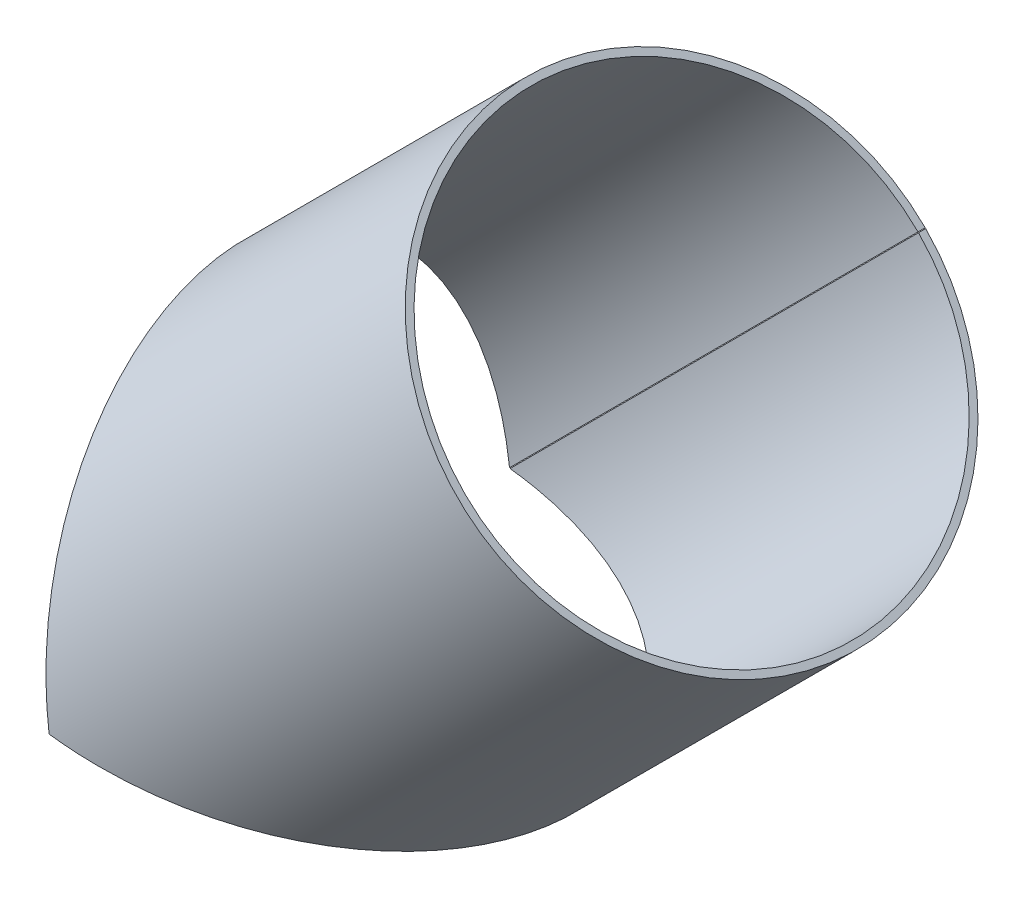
ISO-10303-21;
HEADER;
FILE_DESCRIPTION(('STEP AP214'),'2;1');
FILE_NAME('part.step','',(''),(''),'','','');
FILE_SCHEMA(('AUTOMOTIVE_DESIGN { 1 0 10303 214 1 1 1 1 }'));
ENDSEC;
DATA;
#1=APPLICATION_CONTEXT('core data for automotive mechanical design processes');
#2=APPLICATION_PROTOCOL_DEFINITION('international standard','automotive_design',2000,#1);
#3=PRODUCT_CONTEXT('',#1,'mechanical');
#4=PRODUCT('Part','Part','',(#3));
#5=PRODUCT_RELATED_PRODUCT_CATEGORY('part','',(#4));
#6=PRODUCT_DEFINITION_FORMATION('','',#4);
#7=PRODUCT_DEFINITION_CONTEXT('part definition',#1,'design');
#8=PRODUCT_DEFINITION('design','',#6,#7);
#9=PRODUCT_DEFINITION_SHAPE('','',#8);
#10=(LENGTH_UNIT() NAMED_UNIT(*) SI_UNIT(.MILLI.,.METRE.));
#11=(NAMED_UNIT(*) PLANE_ANGLE_UNIT() SI_UNIT($,.RADIAN.));
#12=(NAMED_UNIT(*) SI_UNIT($,.STERADIAN.) SOLID_ANGLE_UNIT());
#13=UNCERTAINTY_MEASURE_WITH_UNIT(LENGTH_MEASURE(1.E-05),#10,'distance_accuracy_value','');
#14=(GEOMETRIC_REPRESENTATION_CONTEXT(3) GLOBAL_UNCERTAINTY_ASSIGNED_CONTEXT((#13)) GLOBAL_UNIT_ASSIGNED_CONTEXT((#10,
#11,#12)) REPRESENTATION_CONTEXT('',''));
#15=CARTESIAN_POINT('',(0.,0.,0.));
#16=DIRECTION('',(0.,0.,1.));
#17=DIRECTION('',(1.,0.,0.));
#18=AXIS2_PLACEMENT_3D('',#15,#16,#17);
#19=CARTESIAN_POINT('',(15.8183744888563,1016.50372413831,-314.999627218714));
#20=DIRECTION('',(0.707105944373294,-0.707105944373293,-0.00153846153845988));
#21=DIRECTION('',(-0.707106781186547,-0.707106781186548,0.));
#22=AXIS2_PLACEMENT_3D('',#19,#20,#21);
#23=PLANE('',#22);
#24=DIRECTION('',(-0.00108785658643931,0.00108785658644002,-0.999998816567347));
#25=VECTOR('',#24,1.);
#26=CARTESIAN_POINT('',(299.657325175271,1300.34267482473,-314.999627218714));
#27=LINE('',#26,#25);
#28=CARTESIAN_POINT('',(299.657325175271,1300.34267482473,-314.999627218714));
#29=VERTEX_POINT('',#28);
#30=CARTESIAN_POINT('',(299.646446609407,1300.35355339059,-324.999615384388));
#31=VERTEX_POINT('',#30);
#32=EDGE_CURVE('E13',#29,#31,#27,.T.);
#33=ORIENTED_EDGE('',*,*,#32,.F.);
#34=DIRECTION('',(-0.707106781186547,-0.707106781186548,0.));
#35=VECTOR('',#34,1.);
#36=CARTESIAN_POINT('',(299.657325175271,1300.34267482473,-314.999627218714));
#37=LINE('',#36,#35);
#38=CARTESIAN_POINT('',(-268.020576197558,732.664773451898,-314.999627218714));
#39=VERTEX_POINT('',#38);
#40=EDGE_CURVE('E94',#29,#39,#37,.T.);
#41=ORIENTED_EDGE('',*,*,#40,.T.);
#42=CARTESIAN_POINT('',(-268.031454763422,732.675652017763,-324.999615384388));
#43=CARTESIAN_POINT('',(-268.020576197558,732.664773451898,-314.999627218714));
#44=B_SPLINE_CURVE_WITH_KNOTS('',1,(#42,#43),.UNSPECIFIED.,.F.,.F.,(2,2),(0.,1.),.UNSPECIFIED.);
#45=CARTESIAN_POINT('',(-268.031454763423,732.675652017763,-324.999615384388));
#46=VERTEX_POINT('',#45);
#47=EDGE_CURVE('E48',#39,#46,#44,.F.);
#48=ORIENTED_EDGE('',*,*,#47,.T.);
#49=DIRECTION('',(-0.707106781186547,-0.707106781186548,0.));
#50=VECTOR('',#49,1.);
#51=CARTESIAN_POINT('',(2266.17797515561,3266.8850819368,-324.999615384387));
#52=LINE('',#51,#50);
#53=EDGE_CURVE('E93',#31,#46,#52,.T.);
#54=ORIENTED_EDGE('',*,*,#53,.F.);
#55=EDGE_LOOP('',(#33,#41,#48,#54));
#56=FACE_BOUND('',#55,.T.);
#57=ADVANCED_FACE('F38',(#56),#23,.T.);
#58=CARTESIAN_POINT('',(-268.031454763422,732.675652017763,-324.999615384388));
#59=CARTESIAN_POINT('',(-268.96953239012,739.800921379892,-324.990843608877));
#60=CARTESIAN_POINT('',(-269.703148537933,745.372640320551,-324.841068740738));
#61=CARTESIAN_POINT('',(-270.298259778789,749.89368503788,-324.686471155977));
#62=CARTESIAN_POINT('',(-270.360363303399,750.36543918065,-324.669614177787));
#63=CARTESIAN_POINT('',(-270.48238595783,751.292301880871,-324.635286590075));
#64=CARTESIAN_POINT('',(-270.542978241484,751.752539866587,-324.617604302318));
#65=CARTESIAN_POINT('',(-270.72349606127,753.123671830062,-324.563079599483));
#66=CARTESIAN_POINT('',(-270.842162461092,754.024983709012,-324.524759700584));
#67=CARTESIAN_POINT('',(-271.193113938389,756.690579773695,-324.40449806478));
#68=CARTESIAN_POINT('',(-271.420349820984,758.416522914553,-324.317260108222));
#69=CARTESIAN_POINT('',(-271.861336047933,761.766145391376,-324.131764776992));
#70=CARTESIAN_POINT('',(-272.075086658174,763.38982499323,-324.033507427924));
#71=CARTESIAN_POINT('',(-272.489124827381,766.534942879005,-323.828897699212));
#72=CARTESIAN_POINT('',(-272.687993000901,768.045606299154,-323.723366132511));
#73=CARTESIAN_POINT('',(-273.275909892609,772.510974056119,-323.392182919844));
#74=CARTESIAN_POINT('',(-273.658693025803,775.417643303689,-323.15008204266));
#75=CARTESIAN_POINT('',(-274.779171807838,783.926537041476,-322.370432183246));
#76=CARTESIAN_POINT('',(-275.488922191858,789.31757287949,-321.779704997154));
#77=CARTESIAN_POINT('',(-276.497687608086,796.981779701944,-320.826532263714));
#78=CARTESIAN_POINT('',(-276.82465254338,799.466143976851,-320.497585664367));
#79=CARTESIAN_POINT('',(-277.460208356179,804.294336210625,-319.823298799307));
#80=CARTESIAN_POINT('',(-277.769566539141,806.643838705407,-319.47737891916));
#81=CARTESIAN_POINT('',(-279.303842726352,818.296185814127,-317.678817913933));
#82=CARTESIAN_POINT('',(-280.464694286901,827.114123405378,-316.047031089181));
#83=CARTESIAN_POINT('',(-282.106347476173,839.585349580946,-313.420479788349));
#84=CARTESIAN_POINT('',(-282.637832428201,843.621850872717,-312.514397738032));
#85=CARTESIAN_POINT('',(-283.684298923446,851.569658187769,-310.627085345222));
#86=CARTESIAN_POINT('',(-284.197218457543,855.465390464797,-309.649034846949));
#87=CARTESIAN_POINT('',(-285.202344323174,863.100426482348,-307.633696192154));
#88=CARTESIAN_POINT('',(-285.69455171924,866.839731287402,-306.596408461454));
#89=CARTESIAN_POINT('',(-286.658483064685,874.162142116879,-304.471796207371));
#90=CARTESIAN_POINT('',(-287.130614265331,877.747973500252,-303.383885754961));
#91=CARTESIAN_POINT('',(-288.527380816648,888.356293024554,-300.030180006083));
#92=CARTESIAN_POINT('',(-289.428593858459,895.201686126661,-297.682409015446));
#93=CARTESIAN_POINT('',(-291.171065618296,908.43880749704,-292.808702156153));
#94=CARTESIAN_POINT('',(-292.013307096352,914.835840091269,-290.281653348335));
#95=CARTESIAN_POINT('',(-293.653803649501,927.295688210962,-285.03926771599));
#96=CARTESIAN_POINT('',(-294.449984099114,933.343726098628,-282.329234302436));
#97=CARTESIAN_POINT('',(-296.766767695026,950.942626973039,-273.978398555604));
#98=CARTESIAN_POINT('',(-298.226564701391,962.030291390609,-268.078656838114));
#99=CARTESIAN_POINT('',(-300.982276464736,982.961952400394,-255.774938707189));
#100=CARTESIAN_POINT('',(-302.285239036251,992.858879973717,-249.338968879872));
#101=CARTESIAN_POINT('',(-304.74170293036,1011.51772051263,-236.040114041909));
#102=CARTESIAN_POINT('',(-305.900860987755,1020.32186355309,-229.147030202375));
#103=CARTESIAN_POINT('',(-308.080557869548,1036.87912372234,-214.989310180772));
#104=CARTESIAN_POINT('',(-309.104322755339,1044.654209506,-207.706248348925));
#105=CARTESIAN_POINT('',(-311.98027642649,1066.50099546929,-185.361010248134));
#106=CARTESIAN_POINT('',(-313.641678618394,1079.12049639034,-169.787098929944));
#107=CARTESIAN_POINT('',(-316.484759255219,1100.71182461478,-137.594430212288));
#108=CARTESIAN_POINT('',(-317.66353726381,1109.669658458,-120.985276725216));
#109=CARTESIAN_POINT('',(-319.546116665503,1123.96838839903,-87.1304147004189));
#110=CARTESIAN_POINT('',(-320.2494604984,1129.3093080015,-69.8861441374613));
#111=CARTESIAN_POINT('',(-320.951871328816,1134.64552742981,-43.7967943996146));
#112=CARTESIAN_POINT('',(-321.127157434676,1135.97740093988,-35.0684965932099));
#113=CARTESIAN_POINT('',(-321.361207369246,1137.75428309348,-17.5661978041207));
#114=CARTESIAN_POINT('',(-321.419598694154,1138.1987843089,-8.79308753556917));
#115=CARTESIAN_POINT('',(-321.419927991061,1138.20152462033,17.5057045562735));
#116=CARTESIAN_POINT('',(-321.186941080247,1136.43155404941,35.0472772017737));
#117=CARTESIAN_POINT('',(-320.251288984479,1129.32309837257,69.8361675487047));
#118=CARTESIAN_POINT('',(-319.548322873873,1123.98514444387,87.0826161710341));
#119=CARTESIAN_POINT('',(-317.666309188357,1109.69070527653,120.943546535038));
#120=CARTESIAN_POINT('',(-316.487793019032,1100.73498597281,137.555315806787));
#121=CARTESIAN_POINT('',(-313.644691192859,1079.14300090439,169.758072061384));
#122=CARTESIAN_POINT('',(-311.982821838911,1066.52034752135,185.339321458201));
#123=CARTESIAN_POINT('',(-309.106092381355,1044.66772227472,207.693382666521));
#124=CARTESIAN_POINT('',(-308.081842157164,1036.8888099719,214.980669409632));
#125=CARTESIAN_POINT('',(-305.901377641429,1020.32591904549,229.143926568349));
#126=CARTESIAN_POINT('',(-304.741723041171,1011.51772976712,236.04033348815));
#127=CARTESIAN_POINT('',(-302.283799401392,992.848093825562,249.346430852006));
#128=CARTESIAN_POINT('',(-300.98035193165,982.947182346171,255.784479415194));
#129=CARTESIAN_POINT('',(-298.222677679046,962.000910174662,268.09506603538));
#130=CARTESIAN_POINT('',(-296.761954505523,950.90631072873,273.997106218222));
#131=CARTESIAN_POINT('',(-294.444420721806,933.301445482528,282.348561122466));
#132=CARTESIAN_POINT('',(-293.6479959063,927.251550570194,285.058645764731));
#133=CARTESIAN_POINT('',(-292.007044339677,914.788272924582,290.300852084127));
#134=CARTESIAN_POINT('',(-291.164546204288,908.389312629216,292.82776942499));
#135=CARTESIAN_POINT('',(-289.422315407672,895.15389545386,297.699151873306));
#136=CARTESIAN_POINT('',(-288.521186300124,888.309093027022,300.045905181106));
#137=CARTESIAN_POINT('',(-287.124472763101,877.701249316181,303.398245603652));
#138=CARTESIAN_POINT('',(-286.65228754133,874.115085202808,304.485838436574));
#139=CARTESIAN_POINT('',(-285.688878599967,866.796726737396,306.608496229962));
#140=CARTESIAN_POINT('',(-285.196879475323,863.058976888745,307.644991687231));
#141=CARTESIAN_POINT('',(-284.192046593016,855.426090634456,309.659051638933));
#142=CARTESIAN_POINT('',(-283.679211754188,851.530953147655,310.636615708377));
#143=CARTESIAN_POINT('',(-282.632775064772,843.583359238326,312.523191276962));
#144=CARTESIAN_POINT('',(-282.101128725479,839.545725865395,313.429153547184));
#145=CARTESIAN_POINT('',(-280.460721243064,827.084131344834,316.052691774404));
#146=CARTESIAN_POINT('',(-279.300095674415,818.267564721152,317.683860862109));
#147=CARTESIAN_POINT('',(-277.765180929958,806.610453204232,319.48237221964));
#148=CARTESIAN_POINT('',(-277.455414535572,804.257905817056,319.828544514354));
#149=CARTESIAN_POINT('',(-276.820986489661,799.438454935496,320.501294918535));
#150=CARTESIAN_POINT('',(-276.494421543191,796.957132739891,320.829719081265));
#151=CARTESIAN_POINT('',(-275.486342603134,789.298044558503,321.781894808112));
#152=CARTESIAN_POINT('',(-274.776363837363,783.905076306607,322.372724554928));
#153=CARTESIAN_POINT('',(-273.654443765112,775.385197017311,323.152888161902));
#154=CARTESIAN_POINT('',(-273.270997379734,772.473518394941,323.395218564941));
#155=CARTESIAN_POINT('',(-272.681806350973,767.998610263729,323.726719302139));
#156=CARTESIAN_POINT('',(-272.483639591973,766.493310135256,323.831730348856));
#157=CARTESIAN_POINT('',(-272.069993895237,763.35115512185,324.035896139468));
#158=CARTESIAN_POINT('',(-271.856043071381,761.725923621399,324.134139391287));
#159=CARTESIAN_POINT('',(-271.413854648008,758.367121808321,324.319844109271));
#160=CARTESIAN_POINT('',(-271.185616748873,756.633551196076,324.407305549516));
#161=CARTESIAN_POINT('',(-270.832556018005,753.951952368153,324.527929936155));
#162=CARTESIAN_POINT('',(-270.713085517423,753.044545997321,324.566375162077));
#163=CARTESIAN_POINT('',(-270.531209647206,751.663131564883,324.621074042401));
#164=CARTESIAN_POINT('',(-270.470139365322,751.199275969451,324.638812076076));
#165=CARTESIAN_POINT('',(-270.347110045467,750.264797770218,324.673242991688));
#166=CARTESIAN_POINT('',(-270.286193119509,749.802104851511,324.689677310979));
#167=CARTESIAN_POINT('',(-269.701166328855,745.357949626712,324.840917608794));
#168=CARTESIAN_POINT('',(-268.943816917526,739.605716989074,325.));
#169=CARTESIAN_POINT('',(-267.949192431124,732.050807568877,325.));
#170=CARTESIAN_POINT('',(-268.020576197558,732.664773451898,-314.999627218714));
#171=CARTESIAN_POINT('',(-268.834601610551,739.665985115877,-314.991125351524));
#172=CARTESIAN_POINT('',(-269.471213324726,745.140705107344,-314.84595893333));
#173=CARTESIAN_POINT('',(-269.987614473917,749.583039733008,-314.696118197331));
#174=CARTESIAN_POINT('',(-270.041504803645,750.046580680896,-314.679779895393));
#175=CARTESIAN_POINT('',(-270.147390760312,750.957306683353,-314.64650854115));
#176=CARTESIAN_POINT('',(-270.19997027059,751.409531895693,-314.629370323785));
#177=CARTESIAN_POINT('',(-270.35661655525,752.756792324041,-314.576523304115));
#178=CARTESIAN_POINT('',(-270.459590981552,753.642412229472,-314.539382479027));
#179=CARTESIAN_POINT('',(-270.764134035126,756.261599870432,-314.422821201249));
#180=CARTESIAN_POINT('',(-270.961321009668,757.957494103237,-314.338267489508));
#181=CARTESIAN_POINT('',(-271.343990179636,761.248799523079,-314.158479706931));
#182=CARTESIAN_POINT('',(-271.529472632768,762.844210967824,-314.063245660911));
#183=CARTESIAN_POINT('',(-271.888754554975,765.934572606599,-313.86493161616));
#184=CARTESIAN_POINT('',(-272.061322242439,767.418935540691,-313.762647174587));
#185=CARTESIAN_POINT('',(-272.571496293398,771.806560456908,-313.441654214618));
#186=CARTESIAN_POINT('',(-272.903672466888,774.662622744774,-313.207002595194));
#187=CARTESIAN_POINT('',(-273.87600705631,783.023372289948,-312.451341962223));
#188=CARTESIAN_POINT('',(-274.49189919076,788.320549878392,-311.878790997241));
#189=CARTESIAN_POINT('',(-275.367234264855,795.851326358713,-310.9549466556));
#190=CARTESIAN_POINT('',(-275.65094798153,798.292439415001,-310.636121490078));
#191=CARTESIAN_POINT('',(-276.202446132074,803.03657398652,-309.982581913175));
#192=CARTESIAN_POINT('',(-276.470898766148,805.345170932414,-309.647305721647));
#193=CARTESIAN_POINT('',(-277.802303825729,816.794646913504,-307.904085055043));
#194=CARTESIAN_POINT('',(-278.809635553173,825.45906467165,-306.322507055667));
#195=CARTESIAN_POINT('',(-280.234167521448,837.713169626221,-303.776772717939));
#196=CARTESIAN_POINT('',(-280.695375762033,841.679394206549,-302.898570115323));
#197=CARTESIAN_POINT('',(-281.603468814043,849.488828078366,-301.069328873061));
#198=CARTESIAN_POINT('',(-282.04856293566,853.316734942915,-300.121372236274));
#199=CARTESIAN_POINT('',(-282.920763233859,860.818845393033,-298.168044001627));
#200=CARTESIAN_POINT('',(-283.347870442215,864.493050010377,-297.162672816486));
#201=CARTESIAN_POINT('',(-284.184319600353,871.687978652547,-295.103433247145));
#202=CARTESIAN_POINT('',(-284.594020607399,875.21137984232,-294.048996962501));
#203=CARTESIAN_POINT('',(-285.806093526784,885.635005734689,-290.798482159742));
#204=CARTESIAN_POINT('',(-286.588128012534,892.361220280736,-288.522950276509));
#205=CARTESIAN_POINT('',(-288.100144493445,905.367886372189,-283.799203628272));
#206=CARTESIAN_POINT('',(-288.831012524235,911.653545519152,-281.349910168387));
#207=CARTESIAN_POINT('',(-290.254580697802,923.896465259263,-276.268828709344));
#208=CARTESIAN_POINT('',(-290.945465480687,929.839207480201,-273.642180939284));
#209=CARTESIAN_POINT('',(-292.955853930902,947.131713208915,-265.548293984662));
#210=CARTESIAN_POINT('',(-294.222613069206,958.026339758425,-259.830082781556));
#211=CARTESIAN_POINT('',(-296.613903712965,978.593579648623,-247.904940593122));
#212=CARTESIAN_POINT('',(-297.744560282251,988.318201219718,-241.667000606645));
#213=CARTESIAN_POINT('',(-299.87617333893,1006.6521909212,-228.777341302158));
#214=CARTESIAN_POINT('',(-300.882049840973,1015.30305240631,-222.096352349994));
#215=CARTESIAN_POINT('',(-302.773485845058,1031.57205169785,-208.374254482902));
#216=CARTESIAN_POINT('',(-303.661883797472,1039.21177054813,-201.315286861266));
#217=CARTESIAN_POINT('',(-306.157487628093,1060.67820667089,-179.657594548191));
#218=CARTESIAN_POINT('',(-307.59918361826,1073.0780013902,-164.562880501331));
#219=CARTESIAN_POINT('',(-310.066350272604,1094.29341563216,-133.360755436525));
#220=CARTESIAN_POINT('',(-311.089180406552,1103.09530160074,-117.262652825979));
#221=CARTESIAN_POINT('',(-312.722816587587,1117.14508832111,-84.4494788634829));
#222=CARTESIAN_POINT('',(-313.333171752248,1122.39301925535,-67.735801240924));
#223=CARTESIAN_POINT('',(-313.942680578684,1127.63633667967,-42.4492007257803));
#224=CARTESIAN_POINT('',(-314.094779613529,1128.94502311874,-33.9894659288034));
#225=CARTESIAN_POINT('',(-314.297892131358,1130.69096785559,-17.0256994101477));
#226=CARTESIAN_POINT('',(-314.348546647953,1131.1277322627,-8.5225309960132));
#227=CARTESIAN_POINT('',(-314.348828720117,1131.13042534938,16.9670674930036));
#228=CARTESIAN_POINT('',(-314.14665653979,1129.39126950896,33.9688994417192));
#229=CARTESIAN_POINT('',(-313.334759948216,1122.40656933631,67.6873623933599));
#230=CARTESIAN_POINT('',(-312.724731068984,1117.16155263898,84.4031510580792));
#231=CARTESIAN_POINT('',(-311.091585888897,1103.11598197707,117.222206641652));
#232=CARTESIAN_POINT('',(-310.068981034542,1094.31617398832,133.322844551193));
#233=CARTESIAN_POINT('',(-307.601803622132,1073.10011333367,164.534746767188));
#234=CARTESIAN_POINT('',(-306.159696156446,1060.69722183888,179.636573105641));
#235=CARTESIAN_POINT('',(-303.663418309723,1039.22504820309,201.302817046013));
#236=CARTESIAN_POINT('',(-302.774601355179,1031.58156916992,208.365879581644));
#237=CARTESIAN_POINT('',(-300.882496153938,1015.307037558,222.0933442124));
#238=CARTESIAN_POINT('',(-299.876192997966,1006.65219972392,228.777553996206));
#239=CARTESIAN_POINT('',(-297.743308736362,988.307603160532,241.674232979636));
#240=CARTESIAN_POINT('',(-296.612236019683,978.579066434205,247.91418774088));
#241=CARTESIAN_POINT('',(-294.219237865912,957.997470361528,259.845987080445));
#242=CARTESIAN_POINT('',(-292.951673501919,947.096029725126,265.566426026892));
#243=CARTESIAN_POINT('',(-290.940638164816,929.797662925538,273.660913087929));
#244=CARTESIAN_POINT('',(-290.249541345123,923.853096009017,276.287610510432));
#245=CARTESIAN_POINT('',(-288.825577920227,911.606806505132,281.368518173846));
#246=CARTESIAN_POINT('',(-288.094486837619,905.319253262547,283.817684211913));
#247=CARTESIAN_POINT('',(-286.582681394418,892.314261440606,288.539177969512));
#248=CARTESIAN_POINT('',(-285.800720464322,885.58862719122,290.813723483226));
#249=CARTESIAN_POINT('',(-284.588692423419,875.1654689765,294.062914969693));
#250=CARTESIAN_POINT('',(-284.178943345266,871.641741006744,295.117043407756));
#251=CARTESIAN_POINT('',(-283.342946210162,864.450794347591,297.174388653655));
#252=CARTESIAN_POINT('',(-282.916020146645,860.778117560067,298.178991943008));
#253=CARTESIAN_POINT('',(-282.044075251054,853.278119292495,300.131080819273));
#254=CARTESIAN_POINT('',(-281.599055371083,849.45079676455,301.078565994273));
#255=CARTESIAN_POINT('',(-280.690988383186,841.64157255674,302.907093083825));
#256=CARTESIAN_POINT('',(-280.22963865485,837.674235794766,303.785179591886));
#257=CARTESIAN_POINT('',(-278.806185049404,825.429595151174,306.327993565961));
#258=CARTESIAN_POINT('',(-277.799054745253,816.766523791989,307.908972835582));
#259=CARTESIAN_POINT('',(-276.46709425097,805.312366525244,309.652145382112));
#260=CARTESIAN_POINT('',(-276.198286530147,803.000777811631,309.987666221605));
#261=CARTESIAN_POINT('',(-275.64776431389,798.265232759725,310.639716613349));
#262=CARTESIAN_POINT('',(-275.364397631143,795.827108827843,310.958035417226));
#263=CARTESIAN_POINT('',(-274.489659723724,788.301361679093,311.880913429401));
#264=CARTESIAN_POINT('',(-273.873572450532,783.002284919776,312.453563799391));
#265=CARTESIAN_POINT('',(-272.899987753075,774.630741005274,313.209722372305));
#266=CARTESIAN_POINT('',(-272.567235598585,771.769756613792,313.44459645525));
#267=CARTESIAN_POINT('',(-272.05595378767,767.372757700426,313.765897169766));
#268=CARTESIAN_POINT('',(-271.883994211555,765.893664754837,313.867677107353));
#269=CARTESIAN_POINT('',(-271.525053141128,762.806214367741,314.065560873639));
#270=CARTESIAN_POINT('',(-271.339397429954,761.209277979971,314.16078125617));
#271=CARTESIAN_POINT('',(-270.955685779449,757.908952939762,314.340771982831));
#272=CARTESIAN_POINT('',(-270.75762954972,756.205563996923,314.425542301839));
#273=CARTESIAN_POINT('',(-270.451255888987,753.570652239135,314.542455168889));
#274=CARTESIAN_POINT('',(-270.347583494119,752.679043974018,314.579717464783));
#275=CARTESIAN_POINT('',(-270.189758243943,751.32168016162,314.632733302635));
#276=CARTESIAN_POINT('',(-270.136763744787,750.865900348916,314.649925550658));
#277=CARTESIAN_POINT('',(-270.03000377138,749.94769149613,314.683297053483));
#278=CARTESIAN_POINT('',(-269.977142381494,749.493054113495,314.69922570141));
#279=CARTESIAN_POINT('',(-269.469487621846,745.126270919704,314.8458124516));
#280=CARTESIAN_POINT('',(-268.812284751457,739.474178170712,315.));
#281=CARTESIAN_POINT('',(-267.949192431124,732.050807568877,315.));
#282=B_SPLINE_SURFACE_WITH_KNOTS('',1,3,((#58,#59,#60,#61,#62,#63,#64,#65,#66,#67,#68,#69,#70,
#71,#72,#73,#74,#75,#76,#77,#78,#79,#80,#81,#82,#83,#84,#85,#86,#87,#88,#89,#90,#91,#92,#93,#94,
#95,#96,#97,#98,#99,#100,#101,#102,#103,#104,#105,#106,#107,#108,#109,#110,#111,#112,#113,#114,
#115,#116,#117,#118,#119,#120,#121,#122,#123,#124,#125,#126,#127,#128,#129,#130,#131,#132,#133,
#134,#135,#136,#137,#138,#139,#140,#141,#142,#143,#144,#145,#146,#147,#148,#149,#150,#151,#152,
#153,#154,#155,#156,#157,#158,#159,#160,#161,#162,#163,#164,#165,#166,#167,#168,#169),(#170,
#171,#172,#173,#174,#175,#176,#177,#178,#179,#180,#181,#182,#183,#184,#185,#186,#187,#188,#189,
#190,#191,#192,#193,#194,#195,#196,#197,#198,#199,#200,#201,#202,#203,#204,#205,#206,#207,#208,
#209,#210,#211,#212,#213,#214,#215,#216,#217,#218,#219,#220,#221,#222,#223,#224,#225,#226,#227,
#228,#229,#230,#231,#232,#233,#234,#235,#236,#237,#238,#239,#240,#241,#242,#243,#244,#245,#246,
#247,#248,#249,#250,#251,#252,#253,#254,#255,#256,#257,#258,#259,#260,#261,#262,#263,#264,#265,
#266,#267,#268,#269,#270,#271,#272,#273,#274,#275,#276,#277,#278,#279,#280,#281)),.UNSPECIFIED.,
.F.,.F.,.F.,(2,2),(4,2,2,2,2,2,2,2,2,2,2,2,2,2,2,2,2,2,2,2,2,2,2,2,2,2,2,2,2,2,2,2,2,2,2,2,2,2,
2,2,2,2,2,2,2,2,2,2,2,2,2,2,2,2,2,4),(0.,1.),(0.,0.00390625,0.00439453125,0.0048828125,
0.005859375,0.0078125,0.009765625,0.01171875,0.015625,0.0234375,0.02734375,0.03125,0.046875,
0.0546875,0.0625,0.0703125,0.078125,0.09375,0.109375,0.125,0.15625,0.1875,0.21875,0.25,0.3125,
0.375,0.4375,0.46875,0.5,0.5625,0.625,0.6875,0.75,0.78125,0.8125,0.84375,0.875,0.890625,0.90625,
0.921875,0.9296875,0.9375,0.9453125,0.953125,0.96875,0.97265625,0.9765625,0.984375,0.98828125,
0.990234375,0.9921875,0.994140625,0.9951171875,0.99560546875,0.99609375,1.),.UNSPECIFIED.);
#283=CARTESIAN_POINT('',(-268.020576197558,732.664773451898,-314.999627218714));
#284=CARTESIAN_POINT('',(-268.834601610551,739.665985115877,-314.991125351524));
#285=CARTESIAN_POINT('',(-269.471213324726,745.140705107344,-314.84595893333));
#286=CARTESIAN_POINT('',(-269.987614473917,749.583039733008,-314.696118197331));
#287=CARTESIAN_POINT('',(-270.041504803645,750.046580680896,-314.679779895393));
#288=CARTESIAN_POINT('',(-270.147390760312,750.957306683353,-314.64650854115));
#289=CARTESIAN_POINT('',(-270.19997027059,751.409531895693,-314.629370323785));
#290=CARTESIAN_POINT('',(-270.35661655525,752.756792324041,-314.576523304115));
#291=CARTESIAN_POINT('',(-270.459590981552,753.642412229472,-314.539382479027));
#292=CARTESIAN_POINT('',(-270.764134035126,756.261599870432,-314.422821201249));
#293=CARTESIAN_POINT('',(-270.961321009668,757.957494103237,-314.338267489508));
#294=CARTESIAN_POINT('',(-271.343990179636,761.248799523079,-314.158479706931));
#295=CARTESIAN_POINT('',(-271.529472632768,762.844210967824,-314.063245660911));
#296=CARTESIAN_POINT('',(-271.888754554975,765.934572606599,-313.86493161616));
#297=CARTESIAN_POINT('',(-272.061322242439,767.418935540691,-313.762647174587));
#298=CARTESIAN_POINT('',(-272.571496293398,771.806560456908,-313.441654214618));
#299=CARTESIAN_POINT('',(-272.903672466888,774.662622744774,-313.207002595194));
#300=CARTESIAN_POINT('',(-273.87600705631,783.023372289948,-312.451341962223));
#301=CARTESIAN_POINT('',(-274.49189919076,788.320549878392,-311.878790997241));
#302=CARTESIAN_POINT('',(-275.367234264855,795.851326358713,-310.9549466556));
#303=CARTESIAN_POINT('',(-275.65094798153,798.292439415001,-310.636121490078));
#304=CARTESIAN_POINT('',(-276.202446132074,803.03657398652,-309.982581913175));
#305=CARTESIAN_POINT('',(-276.470898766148,805.345170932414,-309.647305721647));
#306=CARTESIAN_POINT('',(-277.802303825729,816.794646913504,-307.904085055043));
#307=CARTESIAN_POINT('',(-278.809635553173,825.45906467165,-306.322507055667));
#308=CARTESIAN_POINT('',(-280.234167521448,837.713169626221,-303.776772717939));
#309=CARTESIAN_POINT('',(-280.695375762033,841.679394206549,-302.898570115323));
#310=CARTESIAN_POINT('',(-281.603468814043,849.488828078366,-301.069328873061));
#311=CARTESIAN_POINT('',(-282.04856293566,853.316734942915,-300.121372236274));
#312=CARTESIAN_POINT('',(-282.920763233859,860.818845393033,-298.168044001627));
#313=CARTESIAN_POINT('',(-283.347870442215,864.493050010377,-297.162672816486));
#314=CARTESIAN_POINT('',(-284.184319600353,871.687978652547,-295.103433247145));
#315=CARTESIAN_POINT('',(-284.594020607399,875.21137984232,-294.048996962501));
#316=CARTESIAN_POINT('',(-285.806093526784,885.635005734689,-290.798482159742));
#317=CARTESIAN_POINT('',(-286.588128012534,892.361220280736,-288.522950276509));
#318=CARTESIAN_POINT('',(-288.100144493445,905.367886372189,-283.799203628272));
#319=CARTESIAN_POINT('',(-288.831012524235,911.653545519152,-281.349910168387));
#320=CARTESIAN_POINT('',(-290.254580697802,923.896465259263,-276.268828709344));
#321=CARTESIAN_POINT('',(-290.945465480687,929.839207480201,-273.642180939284));
#322=CARTESIAN_POINT('',(-292.955853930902,947.131713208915,-265.548293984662));
#323=CARTESIAN_POINT('',(-294.222613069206,958.026339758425,-259.830082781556));
#324=CARTESIAN_POINT('',(-296.613903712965,978.593579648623,-247.904940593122));
#325=CARTESIAN_POINT('',(-297.744560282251,988.318201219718,-241.667000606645));
#326=CARTESIAN_POINT('',(-299.87617333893,1006.6521909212,-228.777341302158));
#327=CARTESIAN_POINT('',(-300.882049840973,1015.30305240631,-222.096352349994));
#328=CARTESIAN_POINT('',(-302.773485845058,1031.57205169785,-208.374254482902));
#329=CARTESIAN_POINT('',(-303.661883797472,1039.21177054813,-201.315286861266));
#330=CARTESIAN_POINT('',(-306.157487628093,1060.67820667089,-179.657594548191));
#331=CARTESIAN_POINT('',(-307.59918361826,1073.0780013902,-164.562880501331));
#332=CARTESIAN_POINT('',(-310.066350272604,1094.29341563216,-133.360755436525));
#333=CARTESIAN_POINT('',(-311.089180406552,1103.09530160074,-117.262652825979));
#334=CARTESIAN_POINT('',(-312.722816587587,1117.14508832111,-84.4494788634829));
#335=CARTESIAN_POINT('',(-313.333171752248,1122.39301925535,-67.735801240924));
#336=CARTESIAN_POINT('',(-313.942680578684,1127.63633667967,-42.4492007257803));
#337=CARTESIAN_POINT('',(-314.094779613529,1128.94502311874,-33.9894659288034));
#338=CARTESIAN_POINT('',(-314.297892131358,1130.69096785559,-17.0256994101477));
#339=CARTESIAN_POINT('',(-314.348546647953,1131.1277322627,-8.5225309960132));
#340=CARTESIAN_POINT('',(-314.348828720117,1131.13042534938,16.9670674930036));
#341=CARTESIAN_POINT('',(-314.14665653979,1129.39126950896,33.9688994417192));
#342=CARTESIAN_POINT('',(-313.334759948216,1122.40656933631,67.6873623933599));
#343=CARTESIAN_POINT('',(-312.724731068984,1117.16155263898,84.4031510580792));
#344=CARTESIAN_POINT('',(-311.091585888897,1103.11598197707,117.222206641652));
#345=CARTESIAN_POINT('',(-310.068981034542,1094.31617398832,133.322844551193));
#346=CARTESIAN_POINT('',(-307.601803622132,1073.10011333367,164.534746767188));
#347=CARTESIAN_POINT('',(-306.159696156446,1060.69722183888,179.636573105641));
#348=CARTESIAN_POINT('',(-303.663418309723,1039.22504820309,201.302817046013));
#349=CARTESIAN_POINT('',(-302.774601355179,1031.58156916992,208.365879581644));
#350=CARTESIAN_POINT('',(-300.882496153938,1015.307037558,222.0933442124));
#351=CARTESIAN_POINT('',(-299.876192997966,1006.65219972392,228.777553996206));
#352=CARTESIAN_POINT('',(-297.743308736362,988.307603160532,241.674232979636));
#353=CARTESIAN_POINT('',(-296.612236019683,978.579066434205,247.91418774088));
#354=CARTESIAN_POINT('',(-294.219237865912,957.997470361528,259.845987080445));
#355=CARTESIAN_POINT('',(-292.951673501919,947.096029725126,265.566426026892));
#356=CARTESIAN_POINT('',(-290.940638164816,929.797662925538,273.660913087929));
#357=CARTESIAN_POINT('',(-290.249541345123,923.853096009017,276.287610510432));
#358=CARTESIAN_POINT('',(-288.825577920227,911.606806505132,281.368518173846));
#359=CARTESIAN_POINT('',(-288.094486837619,905.319253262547,283.817684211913));
#360=CARTESIAN_POINT('',(-286.582681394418,892.314261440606,288.539177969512));
#361=CARTESIAN_POINT('',(-285.800720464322,885.58862719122,290.813723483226));
#362=CARTESIAN_POINT('',(-284.588692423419,875.1654689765,294.062914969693));
#363=CARTESIAN_POINT('',(-284.178943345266,871.641741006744,295.117043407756));
#364=CARTESIAN_POINT('',(-283.342946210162,864.450794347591,297.174388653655));
#365=CARTESIAN_POINT('',(-282.916020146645,860.778117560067,298.178991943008));
#366=CARTESIAN_POINT('',(-282.044075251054,853.278119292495,300.131080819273));
#367=CARTESIAN_POINT('',(-281.599055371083,849.45079676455,301.078565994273));
#368=CARTESIAN_POINT('',(-280.690988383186,841.64157255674,302.907093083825));
#369=CARTESIAN_POINT('',(-280.22963865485,837.674235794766,303.785179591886));
#370=CARTESIAN_POINT('',(-278.806185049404,825.429595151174,306.327993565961));
#371=CARTESIAN_POINT('',(-277.799054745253,816.766523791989,307.908972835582));
#372=CARTESIAN_POINT('',(-276.46709425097,805.312366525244,309.652145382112));
#373=CARTESIAN_POINT('',(-276.198286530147,803.000777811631,309.987666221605));
#374=CARTESIAN_POINT('',(-275.64776431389,798.265232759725,310.639716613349));
#375=CARTESIAN_POINT('',(-275.364397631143,795.827108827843,310.958035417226));
#376=CARTESIAN_POINT('',(-274.489659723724,788.301361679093,311.880913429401));
#377=CARTESIAN_POINT('',(-273.873572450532,783.002284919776,312.453563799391));
#378=CARTESIAN_POINT('',(-272.899987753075,774.630741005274,313.209722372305));
#379=CARTESIAN_POINT('',(-272.567235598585,771.769756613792,313.44459645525));
#380=CARTESIAN_POINT('',(-272.05595378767,767.372757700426,313.765897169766));
#381=CARTESIAN_POINT('',(-271.883994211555,765.893664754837,313.867677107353));
#382=CARTESIAN_POINT('',(-271.525053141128,762.806214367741,314.065560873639));
#383=CARTESIAN_POINT('',(-271.339397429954,761.209277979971,314.16078125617));
#384=CARTESIAN_POINT('',(-270.955685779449,757.908952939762,314.340771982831));
#385=CARTESIAN_POINT('',(-270.75762954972,756.205563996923,314.425542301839));
#386=CARTESIAN_POINT('',(-270.451255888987,753.570652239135,314.542455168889));
#387=CARTESIAN_POINT('',(-270.347583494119,752.679043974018,314.579717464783));
#388=CARTESIAN_POINT('',(-270.189758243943,751.32168016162,314.632733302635));
#389=CARTESIAN_POINT('',(-270.136763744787,750.865900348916,314.649925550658));
#390=CARTESIAN_POINT('',(-270.03000377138,749.94769149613,314.683297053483));
#391=CARTESIAN_POINT('',(-269.977142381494,749.493054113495,314.69922570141));
#392=CARTESIAN_POINT('',(-269.469487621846,745.126270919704,314.8458124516));
#393=CARTESIAN_POINT('',(-268.812284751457,739.474178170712,315.));
#394=CARTESIAN_POINT('',(-267.949192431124,732.050807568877,315.));
#395=B_SPLINE_CURVE_WITH_KNOTS('',3,(#283,#284,#285,#286,#287,#288,#289,#290,#291,#292,#293,
#294,#295,#296,#297,#298,#299,#300,#301,#302,#303,#304,#305,#306,#307,#308,#309,#310,#311,#312,
#313,#314,#315,#316,#317,#318,#319,#320,#321,#322,#323,#324,#325,#326,#327,#328,#329,#330,#331,
#332,#333,#334,#335,#336,#337,#338,#339,#340,#341,#342,#343,#344,#345,#346,#347,#348,#349,#350,
#351,#352,#353,#354,#355,#356,#357,#358,#359,#360,#361,#362,#363,#364,#365,#366,#367,#368,#369,
#370,#371,#372,#373,#374,#375,#376,#377,#378,#379,#380,#381,#382,#383,#384,#385,#386,#387,#388,
#389,#390,#391,#392,#393,#394),.UNSPECIFIED.,.F.,.F.,(4,2,2,2,2,2,2,2,2,2,2,2,2,2,2,2,2,2,2,2,2,
2,2,2,2,2,2,2,2,2,2,2,2,2,2,2,2,2,2,2,2,2,2,2,2,2,2,2,2,2,2,2,2,2,2,4),(0.,0.00390625,
0.00439453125,0.0048828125,0.005859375,0.0078125,0.009765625,0.01171875,0.015625,0.0234375,
0.02734375,0.03125,0.046875,0.0546875,0.0625,0.0703125,0.078125,0.09375,0.109375,0.125,0.15625,
0.1875,0.21875,0.25,0.3125,0.375,0.4375,0.46875,0.5,0.5625,0.625,0.6875,0.75,0.78125,0.8125,
0.84375,0.875,0.890625,0.90625,0.921875,0.9296875,0.9375,0.9453125,0.953125,0.96875,0.97265625,
0.9765625,0.984375,0.98828125,0.990234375,0.9921875,0.994140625,0.9951171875,0.99560546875,
0.99609375,1.),.UNSPECIFIED.);
#396=CARTESIAN_POINT('',(-267.949192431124,732.050807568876,315.));
#397=VERTEX_POINT('',#396);
#398=EDGE_CURVE('E177',#39,#397,#395,.T.);
#399=CARTESIAN_POINT('',(-267.949192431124,732.050807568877,315.));
#400=CARTESIAN_POINT('',(-267.949192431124,732.050807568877,325.));
#401=B_SPLINE_CURVE_WITH_KNOTS('',1,(#399,#400),.UNSPECIFIED.,.F.,.F.,(2,2),(0.,1.),.UNSPECIFIED.);
#402=CARTESIAN_POINT('',(-267.949192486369,732.050807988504,325.));
#403=VERTEX_POINT('',#402);
#404=EDGE_CURVE('E85',#397,#403,#401,.T.);
#405=CARTESIAN_POINT('',(-267.949192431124,732.050807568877,325.));
#406=CARTESIAN_POINT('',(-268.943816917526,739.605716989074,325.));
#407=CARTESIAN_POINT('',(-269.701166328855,745.357949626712,324.840917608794));
#408=CARTESIAN_POINT('',(-270.286193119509,749.802104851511,324.689677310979));
#409=CARTESIAN_POINT('',(-270.347110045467,750.264797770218,324.673242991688));
#410=CARTESIAN_POINT('',(-270.470139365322,751.199275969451,324.638812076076));
#411=CARTESIAN_POINT('',(-270.531209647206,751.663131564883,324.621074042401));
#412=CARTESIAN_POINT('',(-270.713085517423,753.044545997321,324.566375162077));
#413=CARTESIAN_POINT('',(-270.832556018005,753.951952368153,324.527929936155));
#414=CARTESIAN_POINT('',(-271.185616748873,756.633551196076,324.407305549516));
#415=CARTESIAN_POINT('',(-271.413854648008,758.367121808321,324.319844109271));
#416=CARTESIAN_POINT('',(-271.856043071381,761.725923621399,324.134139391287));
#417=CARTESIAN_POINT('',(-272.069993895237,763.35115512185,324.035896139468));
#418=CARTESIAN_POINT('',(-272.483639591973,766.493310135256,323.831730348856));
#419=CARTESIAN_POINT('',(-272.681806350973,767.998610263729,323.726719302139));
#420=CARTESIAN_POINT('',(-273.270997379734,772.473518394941,323.395218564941));
#421=CARTESIAN_POINT('',(-273.654443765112,775.385197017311,323.152888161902));
#422=CARTESIAN_POINT('',(-274.776363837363,783.905076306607,322.372724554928));
#423=CARTESIAN_POINT('',(-275.486342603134,789.298044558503,321.781894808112));
#424=CARTESIAN_POINT('',(-276.494421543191,796.957132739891,320.829719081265));
#425=CARTESIAN_POINT('',(-276.820986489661,799.438454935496,320.501294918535));
#426=CARTESIAN_POINT('',(-277.455414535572,804.257905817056,319.828544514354));
#427=CARTESIAN_POINT('',(-277.765180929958,806.610453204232,319.48237221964));
#428=CARTESIAN_POINT('',(-279.300095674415,818.267564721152,317.683860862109));
#429=CARTESIAN_POINT('',(-280.460721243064,827.084131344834,316.052691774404));
#430=CARTESIAN_POINT('',(-282.101128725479,839.545725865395,313.429153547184));
#431=CARTESIAN_POINT('',(-282.632775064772,843.583359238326,312.523191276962));
#432=CARTESIAN_POINT('',(-283.679211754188,851.530953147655,310.636615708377));
#433=CARTESIAN_POINT('',(-284.192046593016,855.426090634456,309.659051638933));
#434=CARTESIAN_POINT('',(-285.196879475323,863.058976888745,307.644991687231));
#435=CARTESIAN_POINT('',(-285.688878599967,866.796726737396,306.608496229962));
#436=CARTESIAN_POINT('',(-286.65228754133,874.115085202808,304.485838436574));
#437=CARTESIAN_POINT('',(-287.124472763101,877.701249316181,303.398245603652));
#438=CARTESIAN_POINT('',(-288.521186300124,888.309093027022,300.045905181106));
#439=CARTESIAN_POINT('',(-289.422315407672,895.15389545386,297.699151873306));
#440=CARTESIAN_POINT('',(-291.164546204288,908.389312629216,292.82776942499));
#441=CARTESIAN_POINT('',(-292.007044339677,914.788272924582,290.300852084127));
#442=CARTESIAN_POINT('',(-293.6479959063,927.251550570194,285.058645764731));
#443=CARTESIAN_POINT('',(-294.444420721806,933.301445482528,282.348561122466));
#444=CARTESIAN_POINT('',(-296.761954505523,950.90631072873,273.997106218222));
#445=CARTESIAN_POINT('',(-298.222677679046,962.000910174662,268.09506603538));
#446=CARTESIAN_POINT('',(-300.98035193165,982.947182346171,255.784479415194));
#447=CARTESIAN_POINT('',(-302.283799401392,992.848093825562,249.346430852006));
#448=CARTESIAN_POINT('',(-304.741723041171,1011.51772976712,236.04033348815));
#449=CARTESIAN_POINT('',(-305.901377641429,1020.32591904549,229.143926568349));
#450=CARTESIAN_POINT('',(-308.081842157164,1036.8888099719,214.980669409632));
#451=CARTESIAN_POINT('',(-309.106092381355,1044.66772227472,207.693382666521));
#452=CARTESIAN_POINT('',(-311.982821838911,1066.52034752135,185.339321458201));
#453=CARTESIAN_POINT('',(-313.644691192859,1079.14300090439,169.758072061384));
#454=CARTESIAN_POINT('',(-316.487793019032,1100.73498597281,137.555315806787));
#455=CARTESIAN_POINT('',(-317.666309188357,1109.69070527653,120.943546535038));
#456=CARTESIAN_POINT('',(-319.548322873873,1123.98514444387,87.0826161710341));
#457=CARTESIAN_POINT('',(-320.251288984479,1129.32309837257,69.8361675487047));
#458=CARTESIAN_POINT('',(-321.186941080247,1136.43155404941,35.0472772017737));
#459=CARTESIAN_POINT('',(-321.419927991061,1138.20152462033,17.5057045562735));
#460=CARTESIAN_POINT('',(-321.419598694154,1138.1987843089,-8.79308753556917));
#461=CARTESIAN_POINT('',(-321.361207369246,1137.75428309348,-17.5661978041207));
#462=CARTESIAN_POINT('',(-321.127157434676,1135.97740093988,-35.0684965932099));
#463=CARTESIAN_POINT('',(-320.951871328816,1134.64552742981,-43.7967943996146));
#464=CARTESIAN_POINT('',(-320.2494604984,1129.3093080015,-69.8861441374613));
#465=CARTESIAN_POINT('',(-319.546116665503,1123.96838839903,-87.1304147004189));
#466=CARTESIAN_POINT('',(-317.66353726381,1109.669658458,-120.985276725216));
#467=CARTESIAN_POINT('',(-316.484759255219,1100.71182461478,-137.594430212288));
#468=CARTESIAN_POINT('',(-313.641678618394,1079.12049639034,-169.787098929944));
#469=CARTESIAN_POINT('',(-311.98027642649,1066.50099546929,-185.361010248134));
#470=CARTESIAN_POINT('',(-309.104322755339,1044.654209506,-207.706248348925));
#471=CARTESIAN_POINT('',(-308.080557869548,1036.87912372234,-214.989310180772));
#472=CARTESIAN_POINT('',(-305.900860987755,1020.32186355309,-229.147030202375));
#473=CARTESIAN_POINT('',(-304.74170293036,1011.51772051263,-236.040114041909));
#474=CARTESIAN_POINT('',(-302.285239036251,992.858879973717,-249.338968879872));
#475=CARTESIAN_POINT('',(-300.982276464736,982.961952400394,-255.774938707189));
#476=CARTESIAN_POINT('',(-298.226564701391,962.030291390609,-268.078656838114));
#477=CARTESIAN_POINT('',(-296.766767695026,950.942626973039,-273.978398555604));
#478=CARTESIAN_POINT('',(-294.449984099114,933.343726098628,-282.329234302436));
#479=CARTESIAN_POINT('',(-293.653803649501,927.295688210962,-285.03926771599));
#480=CARTESIAN_POINT('',(-292.013307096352,914.835840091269,-290.281653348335));
#481=CARTESIAN_POINT('',(-291.171065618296,908.43880749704,-292.808702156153));
#482=CARTESIAN_POINT('',(-289.428593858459,895.201686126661,-297.682409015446));
#483=CARTESIAN_POINT('',(-288.527380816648,888.356293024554,-300.030180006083));
#484=CARTESIAN_POINT('',(-287.130614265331,877.747973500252,-303.383885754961));
#485=CARTESIAN_POINT('',(-286.658483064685,874.162142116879,-304.471796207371));
#486=CARTESIAN_POINT('',(-285.69455171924,866.839731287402,-306.596408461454));
#487=CARTESIAN_POINT('',(-285.202344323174,863.100426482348,-307.633696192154));
#488=CARTESIAN_POINT('',(-284.197218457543,855.465390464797,-309.649034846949));
#489=CARTESIAN_POINT('',(-283.684298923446,851.569658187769,-310.627085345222));
#490=CARTESIAN_POINT('',(-282.637832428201,843.621850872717,-312.514397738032));
#491=CARTESIAN_POINT('',(-282.106347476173,839.585349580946,-313.420479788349));
#492=CARTESIAN_POINT('',(-280.464694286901,827.114123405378,-316.047031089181));
#493=CARTESIAN_POINT('',(-279.303842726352,818.296185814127,-317.678817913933));
#494=CARTESIAN_POINT('',(-277.769566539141,806.643838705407,-319.47737891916));
#495=CARTESIAN_POINT('',(-277.460208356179,804.294336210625,-319.823298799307));
#496=CARTESIAN_POINT('',(-276.82465254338,799.466143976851,-320.497585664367));
#497=CARTESIAN_POINT('',(-276.497687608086,796.981779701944,-320.826532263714));
#498=CARTESIAN_POINT('',(-275.488922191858,789.31757287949,-321.779704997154));
#499=CARTESIAN_POINT('',(-274.779171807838,783.926537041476,-322.370432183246));
#500=CARTESIAN_POINT('',(-273.658693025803,775.417643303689,-323.15008204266));
#501=CARTESIAN_POINT('',(-273.275909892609,772.510974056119,-323.392182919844));
#502=CARTESIAN_POINT('',(-272.687993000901,768.045606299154,-323.723366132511));
#503=CARTESIAN_POINT('',(-272.489124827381,766.534942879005,-323.828897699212));
#504=CARTESIAN_POINT('',(-272.075086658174,763.38982499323,-324.033507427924));
#505=CARTESIAN_POINT('',(-271.861336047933,761.766145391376,-324.131764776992));
#506=CARTESIAN_POINT('',(-271.420349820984,758.416522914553,-324.317260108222));
#507=CARTESIAN_POINT('',(-271.193113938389,756.690579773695,-324.40449806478));
#508=CARTESIAN_POINT('',(-270.842162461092,754.024983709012,-324.524759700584));
#509=CARTESIAN_POINT('',(-270.72349606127,753.123671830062,-324.563079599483));
#510=CARTESIAN_POINT('',(-270.542978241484,751.752539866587,-324.617604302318));
#511=CARTESIAN_POINT('',(-270.48238595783,751.292301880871,-324.635286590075));
#512=CARTESIAN_POINT('',(-270.360363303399,750.36543918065,-324.669614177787));
#513=CARTESIAN_POINT('',(-270.298259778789,749.89368503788,-324.686471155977));
#514=CARTESIAN_POINT('',(-269.703148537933,745.372640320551,-324.841068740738));
#515=CARTESIAN_POINT('',(-268.96953239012,739.800921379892,-324.990843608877));
#516=CARTESIAN_POINT('',(-268.031454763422,732.675652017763,-324.999615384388));
#517=B_SPLINE_CURVE_WITH_KNOTS('',3,(#405,#406,#407,#408,#409,#410,#411,#412,#413,#414,#415,
#416,#417,#418,#419,#420,#421,#422,#423,#424,#425,#426,#427,#428,#429,#430,#431,#432,#433,#434,
#435,#436,#437,#438,#439,#440,#441,#442,#443,#444,#445,#446,#447,#448,#449,#450,#451,#452,#453,
#454,#455,#456,#457,#458,#459,#460,#461,#462,#463,#464,#465,#466,#467,#468,#469,#470,#471,#472,
#473,#474,#475,#476,#477,#478,#479,#480,#481,#482,#483,#484,#485,#486,#487,#488,#489,#490,#491,
#492,#493,#494,#495,#496,#497,#498,#499,#500,#501,#502,#503,#504,#505,#506,#507,#508,#509,#510,
#511,#512,#513,#514,#515,#516),.UNSPECIFIED.,.F.,.F.,(4,2,2,2,2,2,2,2,2,2,2,2,2,2,2,2,2,2,2,2,2,
2,2,2,2,2,2,2,2,2,2,2,2,2,2,2,2,2,2,2,2,2,2,2,2,2,2,2,2,2,2,2,2,2,2,4),(0.,0.00390625,
0.00439453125,0.0048828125,0.005859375,0.0078125,0.009765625,0.01171875,0.015625,0.0234375,
0.02734375,0.03125,0.046875,0.0546875,0.0625,0.0703125,0.078125,0.09375,0.109375,0.125,0.15625,
0.1875,0.21875,0.25,0.3125,0.375,0.4375,0.5,0.53125,0.5625,0.625,0.6875,0.75,0.78125,0.8125,
0.84375,0.875,0.890625,0.90625,0.921875,0.9296875,0.9375,0.9453125,0.953125,0.96875,0.97265625,
0.9765625,0.984375,0.98828125,0.990234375,0.9921875,0.994140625,0.9951171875,0.99560546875,
0.99609375,1.),.UNSPECIFIED.);
#518=EDGE_CURVE('E104',#46,#403,#517,.F.);
#519=ORIENTED_EDGE('',*,*,#47,.F.);
#520=ORIENTED_EDGE('',*,*,#398,.T.);
#521=ORIENTED_EDGE('',*,*,#404,.T.);
#522=ORIENTED_EDGE('',*,*,#518,.F.);
#523=EDGE_LOOP('',(#519,#520,#521,#522));
#524=FACE_BOUND('',#523,.T.);
#525=ADVANCED_FACE('F110',(#524),#282,.T.);
#526=CARTESIAN_POINT('',(-267.949192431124,732.050807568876,325.));
#527=CARTESIAN_POINT('',(-260.328637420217,731.047529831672,325.));
#528=CARTESIAN_POINT('',(-254.553112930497,730.287129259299,324.838429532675));
#529=CARTESIAN_POINT('',(-250.13031268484,729.704909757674,324.687304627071));
#530=CARTESIAN_POINT('',(-249.668629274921,729.644125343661,324.670846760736));
#531=CARTESIAN_POINT('',(-248.73512458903,729.52122399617,324.636329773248));
#532=CARTESIAN_POINT('',(-248.271752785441,729.460217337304,324.618550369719));
#533=CARTESIAN_POINT('',(-246.891780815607,729.27853122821,324.563732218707));
#534=CARTESIAN_POINT('',(-245.98532420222,729.159185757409,324.525213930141));
#535=CARTESIAN_POINT('',(-243.306538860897,728.806495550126,324.404388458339));
#536=CARTESIAN_POINT('',(-241.574796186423,728.578498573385,324.316817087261));
#537=CARTESIAN_POINT('',(-238.219554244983,728.136779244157,324.130934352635));
#538=CARTESIAN_POINT('',(-236.596054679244,727.923056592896,324.032623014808));
#539=CARTESIAN_POINT('',(-233.457267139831,727.509854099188,323.828356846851));
#540=CARTESIAN_POINT('',(-231.953429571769,727.311879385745,323.723304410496));
#541=CARTESIAN_POINT('',(-227.481051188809,726.72302015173,323.391570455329));
#542=CARTESIAN_POINT('',(-224.57100598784,726.339788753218,323.149116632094));
#543=CARTESIAN_POINT('',(-216.055866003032,725.218493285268,322.368664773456));
#544=CARTESIAN_POINT('',(-210.665842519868,724.508903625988,321.777751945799));
#545=CARTESIAN_POINT('',(-203.010845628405,723.501363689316,320.825563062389));
#546=CARTESIAN_POINT('',(-200.530832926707,723.174971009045,320.497153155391));
#547=CARTESIAN_POINT('',(-195.713892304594,722.540872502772,319.824460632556));
#548=CARTESIAN_POINT('',(-193.362091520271,722.231204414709,319.478264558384));
#549=CARTESIAN_POINT('',(-181.70933837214,720.696863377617,317.679780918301));
#550=CARTESIAN_POINT('',(-172.895834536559,719.536641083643,316.048788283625));
#551=CARTESIAN_POINT('',(-160.438198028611,717.896754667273,313.425611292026));
#552=CARTESIAN_POINT('',(-156.40162160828,717.365247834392,312.519749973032));
#553=CARTESIAN_POINT('',(-148.456141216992,716.319089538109,310.633428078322));
#554=CARTESIAN_POINT('',(-144.562006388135,715.806386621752,309.656006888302));
#555=CARTESIAN_POINT('',(-136.931017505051,714.801803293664,307.642255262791));
#556=CARTESIAN_POINT('',(-133.194162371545,714.309921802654,306.605925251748));
#557=CARTESIAN_POINT('',(-125.877486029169,713.346734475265,304.483611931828));
#558=CARTESIAN_POINT('',(-122.292110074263,712.874654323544,303.396196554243));
#559=CARTESIAN_POINT('',(-111.687131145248,711.47832678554,300.04461637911));
#560=CARTESIAN_POINT('',(-104.844670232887,710.577515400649,297.698607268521));
#561=CARTESIAN_POINT('',(-91.6147539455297,708.835995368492,292.829291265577));
#562=CARTESIAN_POINT('',(-85.2189962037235,707.993905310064,290.303711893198));
#563=CARTESIAN_POINT('',(-72.7631988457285,706.353949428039,285.065045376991));
#564=CARTESIAN_POINT('',(-66.71754609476,705.558092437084,282.357144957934));
#565=CARTESIAN_POINT('',(-49.1268076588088,703.242366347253,274.013659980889));
#566=CARTESIAN_POINT('',(-38.0419723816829,701.782962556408,268.118189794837));
#567=CARTESIAN_POINT('',(-17.1151559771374,699.027860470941,255.823185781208));
#568=CARTESIAN_POINT('',(-7.22223990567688,697.725453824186,249.393128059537));
#569=CARTESIAN_POINT('',(11.4333723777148,695.269388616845,236.103857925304));
#570=CARTESIAN_POINT('',(20.235849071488,694.110473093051,229.216084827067));
#571=CARTESIAN_POINT('',(36.7898269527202,691.931192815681,215.07011694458));
#572=CARTESIAN_POINT('',(44.5650442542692,690.907420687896,207.791927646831));
#573=CARTESIAN_POINT('',(66.4105014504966,688.031638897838,185.464520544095));
#574=CARTESIAN_POINT('',(79.0317248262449,686.369971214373,169.902130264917));
#575=CARTESIAN_POINT('',(100.629288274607,683.52609704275,137.734615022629));
#576=CARTESIAN_POINT('',(109.592028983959,682.346677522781,121.138941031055));
#577=CARTESIAN_POINT('',(123.906124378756,680.462087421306,87.3076815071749));
#578=CARTESIAN_POINT('',(129.256630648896,679.757470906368,70.0751721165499));
#579=CARTESIAN_POINT('',(136.394852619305,678.817877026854,35.3119350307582));
#580=CARTESIAN_POINT('',(138.18206459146,678.582609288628,17.7856547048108));
#581=CARTESIAN_POINT('',(138.208322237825,678.579158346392,-8.50327248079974));
#582=CARTESIAN_POINT('',(137.772939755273,678.636330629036,-17.2911000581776));
#583=CARTESIAN_POINT('',(136.012957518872,678.868149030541,-34.8067105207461));
#584=CARTESIAN_POINT('',(134.688963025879,679.042428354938,-43.5416943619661));
#585=CARTESIAN_POINT('',(129.374262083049,679.741982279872,-69.6523666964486));
#586=CARTESIAN_POINT('',(124.045015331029,680.443815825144,-86.9119822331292));
#587=CARTESIAN_POINT('',(109.764381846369,682.323975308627,-120.797575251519));
#588=CARTESIAN_POINT('',(100.81394629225,683.501799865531,-137.420990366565));
#589=CARTESIAN_POINT('',(79.2276901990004,686.344144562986,-169.648171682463));
#590=CARTESIAN_POINT('',(66.6053645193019,688.005985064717,-185.24237759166));
#591=CARTESIAN_POINT('',(44.7466891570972,690.883508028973,-207.617545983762));
#592=CARTESIAN_POINT('',(36.9658280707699,691.908022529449,-214.911034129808));
#593=CARTESIAN_POINT('',(20.3958656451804,694.089406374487,-229.087853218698));
#594=CARTESIAN_POINT('',(11.583776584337,695.249591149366,-235.990524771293));
#595=CARTESIAN_POINT('',(-7.09427484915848,697.708604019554,-249.308074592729));
#596=CARTESIAN_POINT('',(-17.0015326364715,699.012907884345,-255.752534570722));
#597=CARTESIAN_POINT('',(-37.9588080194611,701.772008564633,-268.07318780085));
#598=CARTESIAN_POINT('',(-49.0589384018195,703.233483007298,-273.979632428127));
#599=CARTESIAN_POINT('',(-66.6749934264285,705.552454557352,-282.337869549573));
#600=CARTESIAN_POINT('',(-72.7280022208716,706.349304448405,-285.049723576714));
#601=CARTESIAN_POINT('',(-85.1961963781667,707.990918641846,-290.294640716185));
#602=CARTESIAN_POINT('',(-91.5965435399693,708.833579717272,-292.822370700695));
#603=CARTESIAN_POINT('',(-104.838557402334,710.576680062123,-297.696559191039));
#604=CARTESIAN_POINT('',(-111.685866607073,711.478156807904,-300.044256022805));
#605=CARTESIAN_POINT('',(-122.296224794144,712.875202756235,-303.39747868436));
#606=CARTESIAN_POINT('',(-125.882547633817,713.347400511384,-304.485152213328));
#607=CARTESIAN_POINT('',(-133.205752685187,714.31143736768,-306.609212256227));
#608=CARTESIAN_POINT('',(-136.945529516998,714.803706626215,-307.646232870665));
#609=CARTESIAN_POINT('',(-144.581660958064,715.80897596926,-309.661043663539));
#610=CARTESIAN_POINT('',(-148.47801663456,716.32197712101,-310.638833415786));
#611=CARTESIAN_POINT('',(-156.427223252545,717.368627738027,-312.525618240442));
#612=CARTESIAN_POINT('',(-160.464485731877,717.900213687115,-313.431431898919));
#613=CARTESIAN_POINT('',(-172.938220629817,719.542198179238,-316.05713492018));
#614=CARTESIAN_POINT('',(-181.758424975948,720.70334706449,-317.688358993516));
#615=CARTESIAN_POINT('',(-193.414352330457,722.238094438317,-319.486078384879));
#616=CARTESIAN_POINT('',(-195.764549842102,722.547544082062,-319.831817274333));
#617=CARTESIAN_POINT('',(-200.594818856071,723.183372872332,-320.505797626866));
#618=CARTESIAN_POINT('',(-203.080305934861,723.510485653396,-320.834580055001));
#619=CARTESIAN_POINT('',(-210.748134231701,724.519728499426,-321.787212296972));
#620=CARTESIAN_POINT('',(-216.141921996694,725.229842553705,-322.377515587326));
#621=CARTESIAN_POINT('',(-224.655446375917,726.350931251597,-323.15636597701));
#622=CARTESIAN_POINT('',(-227.563742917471,726.733928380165,-323.398172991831));
#623=CARTESIAN_POINT('',(-232.031676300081,727.322181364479,-323.728864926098));
#624=CARTESIAN_POINT('',(-233.544265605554,727.521302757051,-323.834298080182));
#625=CARTESIAN_POINT('',(-236.693064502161,727.935825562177,-324.03863949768));
#626=CARTESIAN_POINT('',(-238.318661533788,728.149828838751,-324.136742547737));
#627=CARTESIAN_POINT('',(-241.672272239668,728.591340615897,-324.321881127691));
#628=CARTESIAN_POINT('',(-243.400286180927,728.818849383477,-324.408916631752));
#629=CARTESIAN_POINT('',(-246.069102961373,729.170224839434,-324.528832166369));
#630=CARTESIAN_POINT('',(-246.971507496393,729.289035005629,-324.567029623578));
#631=CARTESIAN_POINT('',(-248.801906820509,729.530017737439,-324.63946909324));
#632=CARTESIAN_POINT('',(-249.704593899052,729.648861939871,-324.672931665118));
#633=CARTESIAN_POINT('',(-254.747278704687,730.31263785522,-324.844326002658));
#634=CARTESIAN_POINT('',(-260.284201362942,731.04168957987,-324.990948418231));
#635=CARTESIAN_POINT('',(-267.324347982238,731.968545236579,-324.999615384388));
#636=CARTESIAN_POINT('',(-267.949192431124,732.050807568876,315.));
#637=CARTESIAN_POINT('',(-260.461319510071,731.180205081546,315.));
#638=CARTESIAN_POINT('',(-254.786339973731,730.520356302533,314.84340093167));
#639=CARTESIAN_POINT('',(-250.440540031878,730.015137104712,314.696926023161));
#640=CARTESIAN_POINT('',(-249.986894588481,729.962390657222,314.680974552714));
#641=CARTESIAN_POINT('',(-249.069642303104,729.855741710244,314.647519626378));
#642=CARTESIAN_POINT('',(-248.614337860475,729.802802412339,314.63028728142));
#643=CARTESIAN_POINT('',(-247.258391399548,729.645141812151,314.577155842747));
#644=CARTESIAN_POINT('',(-246.367716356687,729.541577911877,314.53982273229));
#645=CARTESIAN_POINT('',(-243.735569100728,729.235525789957,314.422714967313));
#646=CARTESIAN_POINT('',(-242.033976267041,729.037678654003,314.33783809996));
#647=CARTESIAN_POINT('',(-238.737149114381,728.654374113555,314.157674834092));
#648=CARTESIAN_POINT('',(-237.141914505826,728.468916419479,314.062388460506));
#649=CARTESIAN_POINT('',(-234.057772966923,728.11035992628,313.864407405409));
#650=CARTESIAN_POINT('',(-232.580117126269,727.938566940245,313.762587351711));
#651=CARTESIAN_POINT('',(-228.185603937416,727.427572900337,313.441060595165));
#652=CARTESIAN_POINT('',(-225.326224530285,727.095007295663,313.206066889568));
#653=CARTESIAN_POINT('',(-216.959337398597,726.121964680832,312.449628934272));
#654=CARTESIAN_POINT('',(-211.663154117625,725.506215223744,311.876898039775));
#655=CARTESIAN_POINT('',(-204.141427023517,724.631945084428,310.954007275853));
#656=CARTESIAN_POINT('',(-201.704589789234,724.348727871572,310.635702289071));
#657=CARTESIAN_POINT('',(-196.971511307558,723.798491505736,309.983707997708));
#658=CARTESIAN_POINT('',(-194.660656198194,723.529769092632,309.648164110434));
#659=CARTESIAN_POINT('',(-183.210781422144,722.198306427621,307.905018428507));
#660=CARTESIAN_POINT('',(-174.550719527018,721.191526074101,306.32421018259));
#661=CARTESIAN_POINT('',(-162.309967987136,719.768524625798,303.781746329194));
#662=CARTESIAN_POINT('',(-158.3436697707,719.307295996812,302.90375766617));
#663=CARTESIAN_POINT('',(-150.536522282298,718.399470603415,301.075476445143));
#664=CARTESIAN_POINT('',(-146.710184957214,717.954565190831,300.128129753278));
#665=CARTESIAN_POINT('',(-139.212051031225,717.082836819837,298.176339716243));
#666=CARTESIAN_POINT('',(-135.540253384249,716.656012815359,297.171896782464));
#667=CARTESIAN_POINT('',(-128.35095955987,715.820208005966,295.114885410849));
#668=CARTESIAN_POINT('',(-124.828006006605,715.410550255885,294.060928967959));
#669=CARTESIAN_POINT('',(-114.407662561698,714.19885820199,290.812474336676));
#670=CARTESIAN_POINT('',(-107.684328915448,713.41717408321,288.538650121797));
#671=CARTESIAN_POINT('',(-94.6847424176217,711.905983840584,283.819159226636));
#672=CARTESIAN_POINT('',(-88.4003361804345,711.175245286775,281.371289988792));
#673=CARTESIAN_POINT('',(-76.1613965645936,709.752147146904,276.293813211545));
#674=CARTESIAN_POINT('',(-70.2209978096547,709.061544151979,273.669232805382));
#675=CARTESIAN_POINT('',(-52.9365126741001,707.052071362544,265.582470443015));
#676=CARTESIAN_POINT('',(-42.0446656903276,705.785655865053,259.868399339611));
#677=CARTESIAN_POINT('',(-21.4821864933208,703.394890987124,247.951703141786));
#678=CARTESIAN_POINT('',(-11.7615061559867,702.264720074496,241.719493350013));
#679=CARTESIAN_POINT('',(6.56931108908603,700.133449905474,228.839123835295));
#680=CARTESIAN_POINT('',(15.2185355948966,699.127786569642,222.163282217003));
#681=CARTESIAN_POINT('',(31.4843095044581,697.236710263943,208.452574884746));
#682=CARTESIAN_POINT('',(39.1241577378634,696.348307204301,201.398329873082));
#683=CARTESIAN_POINT('',(60.5892881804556,693.852852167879,179.757919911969));
#684=CARTESIAN_POINT('',(72.9907747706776,692.410921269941,164.674372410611));
#685=CARTESIAN_POINT('',(94.2123161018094,689.943069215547,133.496626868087));
#686=CARTESIAN_POINT('',(103.019023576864,688.919682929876,117.41158899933));
#687=CARTESIAN_POINT('',(117.083908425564,687.284303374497,84.6212913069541));
#688=CARTESIAN_POINT('',(122.341258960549,686.672842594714,67.9190129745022));
#689=CARTESIAN_POINT('',(129.35520684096,685.8575228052,34.2254139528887));
#690=CARTESIAN_POINT('',(131.111303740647,685.653370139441,17.2384037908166));
#691=CARTESIAN_POINT('',(131.137104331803,685.650376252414,-8.24163332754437));
#692=CARTESIAN_POINT('',(130.709299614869,685.69997076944,-16.7590662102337));
#693=CARTESIAN_POINT('',(128.979960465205,685.901146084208,-33.7357348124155));
#694=CARTESIAN_POINT('',(127.679016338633,686.052375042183,-42.2019499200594));
#695=CARTESIAN_POINT('',(122.45684239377,686.659401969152,-67.5092169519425));
#696=CARTESIAN_POINT('',(117.220381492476,687.268449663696,-84.2377673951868));
#697=CARTESIAN_POINT('',(103.188375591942,688.899981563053,-117.080726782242));
#698=CARTESIAN_POINT('',(94.3937594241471,689.921986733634,-133.19265220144));
#699=CARTESIAN_POINT('',(73.1833279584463,692.38850680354,-164.428227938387));
#700=CARTESIAN_POINT('',(60.780758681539,693.830590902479,-179.542612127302));
#701=CARTESIAN_POINT('',(39.3026402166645,696.327556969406,-201.229313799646));
#702=CARTESIAN_POINT('',(31.6572464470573,697.216604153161,-208.298386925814));
#703=CARTESIAN_POINT('',(15.3757662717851,699.109505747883,-222.038996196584));
#704=CARTESIAN_POINT('',(6.71709680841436,700.116270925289,-228.729277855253));
#705=CARTESIAN_POINT('',(-11.6357690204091,702.250098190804,-241.637056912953));
#706=CARTESIAN_POINT('',(-21.3705412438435,703.381916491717,-247.8832258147));
#707=CARTESIAN_POINT('',(-41.9629493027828,705.776149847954,-259.824782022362));
#708=CARTESIAN_POINT('',(-52.8698242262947,707.044368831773,-265.549489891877));
#709=CARTESIAN_POINT('',(-70.1791865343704,709.056647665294,-273.650550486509));
#710=CARTESIAN_POINT('',(-76.1268128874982,709.748115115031,-276.278962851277));
#711=CARTESIAN_POINT('',(-88.3779330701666,711.172655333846,-281.362497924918));
#712=CARTESIAN_POINT('',(-94.6668493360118,711.903885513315,-283.812451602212));
#713=CARTESIAN_POINT('',(-107.678322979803,713.416445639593,-288.536665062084));
#714=CARTESIAN_POINT('',(-114.406420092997,714.198710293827,-290.812125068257));
#715=CARTESIAN_POINT('',(-124.832048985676,715.411026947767,-294.062171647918));
#716=CARTESIAN_POINT('',(-128.355933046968,715.820785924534,-295.116378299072));
#717=CARTESIAN_POINT('',(-135.551642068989,716.657326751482,-297.175082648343));
#718=CARTESIAN_POINT('',(-139.22631049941,717.084487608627,-298.180194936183));
#719=CARTESIAN_POINT('',(-146.729497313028,717.956812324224,-300.133011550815));
#720=CARTESIAN_POINT('',(-150.558016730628,718.401977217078,-301.080715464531));
#721=CARTESIAN_POINT('',(-158.368825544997,719.31023003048,-302.909445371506));
#722=CARTESIAN_POINT('',(-162.335798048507,719.771526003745,-303.78738784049));
#723=CARTESIAN_POINT('',(-174.592368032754,721.196345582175,-306.332299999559));
#724=CARTESIAN_POINT('',(-183.259013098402,722.203935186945,-307.913332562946));
#725=CARTESIAN_POINT('',(-194.712006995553,723.535749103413,-309.655737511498));
#726=CARTESIAN_POINT('',(-197.021286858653,723.804281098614,-309.990838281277));
#727=CARTESIAN_POINT('',(-201.76746206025,724.35601607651,-310.644080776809));
#728=CARTESIAN_POINT('',(-204.209678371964,724.639858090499,-310.96274682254));
#729=CARTESIAN_POINT('',(-211.744013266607,725.515607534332,-311.886067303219));
#730=CARTESIAN_POINT('',(-217.043894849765,726.131815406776,-312.458207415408));
#731=CARTESIAN_POINT('',(-225.409194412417,727.104679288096,-313.213093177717));
#732=CARTESIAN_POINT('',(-228.266855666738,727.437041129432,-313.447459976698));
#733=CARTESIAN_POINT('',(-232.657001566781,727.947506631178,-313.767976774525));
#734=CARTESIAN_POINT('',(-234.143256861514,728.120294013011,-313.870165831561));
#735=CARTESIAN_POINT('',(-237.237235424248,728.479996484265,-314.068219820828));
#736=CARTESIAN_POINT('',(-238.834530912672,728.665698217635,-314.163304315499));
#737=CARTESIAN_POINT('',(-242.129755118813,729.048823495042,-314.342746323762));
#738=CARTESIAN_POINT('',(-243.827684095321,729.246247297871,-314.427103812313));
#739=CARTESIAN_POINT('',(-246.450036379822,729.551158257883,-314.543329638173));
#740=CARTESIAN_POINT('',(-247.336729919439,729.654257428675,-314.580351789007));
#741=CARTESIAN_POINT('',(-249.13526182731,729.86337274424,-314.650562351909));
#742=CARTESIAN_POINT('',(-250.022233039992,729.966501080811,-314.682995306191));
#743=CARTESIAN_POINT('',(-254.977126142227,730.54248529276,-314.849115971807));
#744=CARTESIAN_POINT('',(-260.417655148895,731.175138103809,-314.99122693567));
#745=CARTESIAN_POINT('',(-267.335226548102,731.979423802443,-314.999627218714));
#746=B_SPLINE_SURFACE_WITH_KNOTS('',1,3,((#526,#527,#528,#529,#530,#531,#532,#533,#534,#535,
#536,#537,#538,#539,#540,#541,#542,#543,#544,#545,#546,#547,#548,#549,#550,#551,#552,#553,#554,
#555,#556,#557,#558,#559,#560,#561,#562,#563,#564,#565,#566,#567,#568,#569,#570,#571,#572,#573,
#574,#575,#576,#577,#578,#579,#580,#581,#582,#583,#584,#585,#586,#587,#588,#589,#590,#591,#592,
#593,#594,#595,#596,#597,#598,#599,#600,#601,#602,#603,#604,#605,#606,#607,#608,#609,#610,#611,
#612,#613,#614,#615,#616,#617,#618,#619,#620,#621,#622,#623,#624,#625,#626,#627,#628,#629,#630,
#631,#632,#633,#634,#635),(#636,#637,#638,#639,#640,#641,#642,#643,#644,#645,#646,#647,#648,
#649,#650,#651,#652,#653,#654,#655,#656,#657,#658,#659,#660,#661,#662,#663,#664,#665,#666,#667,
#668,#669,#670,#671,#672,#673,#674,#675,#676,#677,#678,#679,#680,#681,#682,#683,#684,#685,#686,
#687,#688,#689,#690,#691,#692,#693,#694,#695,#696,#697,#698,#699,#700,#701,#702,#703,#704,#705,
#706,#707,#708,#709,#710,#711,#712,#713,#714,#715,#716,#717,#718,#719,#720,#721,#722,#723,#724,
#725,#726,#727,#728,#729,#730,#731,#732,#733,#734,#735,#736,#737,#738,#739,#740,#741,#742,#743,
#744,#745)),.UNSPECIFIED.,.F.,.F.,.F.,(2,2),(4,2,2,2,2,2,2,2,2,2,2,2,2,2,2,2,2,2,2,2,2,2,2,2,2,
2,2,2,2,2,2,2,2,2,2,2,2,2,2,2,2,2,2,2,2,2,2,2,2,2,2,2,2,2,4),(0.,1.),(0.,0.00390625,
0.00439453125,0.0048828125,0.005859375,0.0078125,0.009765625,0.01171875,0.015625,0.0234375,
0.02734375,0.03125,0.046875,0.0546875,0.0625,0.0703125,0.078125,0.09375,0.109375,0.125,0.15625,
0.1875,0.21875,0.25,0.3125,0.375,0.4375,0.5,0.53125,0.5625,0.625,0.6875,0.75,0.78125,0.8125,
0.84375,0.875,0.890625,0.90625,0.921875,0.9296875,0.9375,0.9453125,0.953125,0.96875,0.97265625,
0.9765625,0.984375,0.98828125,0.990234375,0.9921875,0.994140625,0.9951171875,0.99609375,1.),.UNSPECIFIED.);
#747=CARTESIAN_POINT('',(-267.949192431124,732.050807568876,315.));
#748=CARTESIAN_POINT('',(-260.461319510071,731.180205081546,315.));
#749=CARTESIAN_POINT('',(-254.786339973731,730.520356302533,314.84340093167));
#750=CARTESIAN_POINT('',(-250.440540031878,730.015137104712,314.696926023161));
#751=CARTESIAN_POINT('',(-249.986894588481,729.962390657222,314.680974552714));
#752=CARTESIAN_POINT('',(-249.069642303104,729.855741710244,314.647519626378));
#753=CARTESIAN_POINT('',(-248.614337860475,729.802802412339,314.63028728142));
#754=CARTESIAN_POINT('',(-247.258391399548,729.645141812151,314.577155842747));
#755=CARTESIAN_POINT('',(-246.367716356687,729.541577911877,314.53982273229));
#756=CARTESIAN_POINT('',(-243.735569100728,729.235525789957,314.422714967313));
#757=CARTESIAN_POINT('',(-242.033976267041,729.037678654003,314.33783809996));
#758=CARTESIAN_POINT('',(-238.737149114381,728.654374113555,314.157674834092));
#759=CARTESIAN_POINT('',(-237.141914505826,728.468916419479,314.062388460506));
#760=CARTESIAN_POINT('',(-234.057772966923,728.11035992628,313.864407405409));
#761=CARTESIAN_POINT('',(-232.580117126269,727.938566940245,313.762587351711));
#762=CARTESIAN_POINT('',(-228.185603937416,727.427572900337,313.441060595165));
#763=CARTESIAN_POINT('',(-225.326224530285,727.095007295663,313.206066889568));
#764=CARTESIAN_POINT('',(-216.959337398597,726.121964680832,312.449628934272));
#765=CARTESIAN_POINT('',(-211.663154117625,725.506215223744,311.876898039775));
#766=CARTESIAN_POINT('',(-204.141427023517,724.631945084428,310.954007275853));
#767=CARTESIAN_POINT('',(-201.704589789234,724.348727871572,310.635702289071));
#768=CARTESIAN_POINT('',(-196.971511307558,723.798491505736,309.983707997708));
#769=CARTESIAN_POINT('',(-194.660656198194,723.529769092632,309.648164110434));
#770=CARTESIAN_POINT('',(-183.210781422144,722.198306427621,307.905018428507));
#771=CARTESIAN_POINT('',(-174.550719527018,721.191526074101,306.32421018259));
#772=CARTESIAN_POINT('',(-162.309967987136,719.768524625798,303.781746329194));
#773=CARTESIAN_POINT('',(-158.3436697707,719.307295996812,302.90375766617));
#774=CARTESIAN_POINT('',(-150.536522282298,718.399470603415,301.075476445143));
#775=CARTESIAN_POINT('',(-146.710184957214,717.954565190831,300.128129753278));
#776=CARTESIAN_POINT('',(-139.212051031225,717.082836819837,298.176339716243));
#777=CARTESIAN_POINT('',(-135.540253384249,716.656012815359,297.171896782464));
#778=CARTESIAN_POINT('',(-128.35095955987,715.820208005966,295.114885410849));
#779=CARTESIAN_POINT('',(-124.828006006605,715.410550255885,294.060928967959));
#780=CARTESIAN_POINT('',(-114.407662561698,714.19885820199,290.812474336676));
#781=CARTESIAN_POINT('',(-107.684328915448,713.41717408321,288.538650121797));
#782=CARTESIAN_POINT('',(-94.6847424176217,711.905983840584,283.819159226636));
#783=CARTESIAN_POINT('',(-88.4003361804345,711.175245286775,281.371289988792));
#784=CARTESIAN_POINT('',(-76.1613965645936,709.752147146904,276.293813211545));
#785=CARTESIAN_POINT('',(-70.2209978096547,709.061544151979,273.669232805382));
#786=CARTESIAN_POINT('',(-52.9365126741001,707.052071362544,265.582470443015));
#787=CARTESIAN_POINT('',(-42.0446656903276,705.785655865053,259.868399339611));
#788=CARTESIAN_POINT('',(-21.4821864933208,703.394890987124,247.951703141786));
#789=CARTESIAN_POINT('',(-11.7615061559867,702.264720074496,241.719493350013));
#790=CARTESIAN_POINT('',(6.56931108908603,700.133449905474,228.839123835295));
#791=CARTESIAN_POINT('',(15.2185355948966,699.127786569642,222.163282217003));
#792=CARTESIAN_POINT('',(31.4843095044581,697.236710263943,208.452574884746));
#793=CARTESIAN_POINT('',(39.1241577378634,696.348307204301,201.398329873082));
#794=CARTESIAN_POINT('',(60.5892881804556,693.852852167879,179.757919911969));
#795=CARTESIAN_POINT('',(72.9907747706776,692.410921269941,164.674372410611));
#796=CARTESIAN_POINT('',(94.2123161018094,689.943069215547,133.496626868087));
#797=CARTESIAN_POINT('',(103.019023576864,688.919682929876,117.41158899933));
#798=CARTESIAN_POINT('',(117.083908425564,687.284303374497,84.6212913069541));
#799=CARTESIAN_POINT('',(122.341258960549,686.672842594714,67.9190129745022));
#800=CARTESIAN_POINT('',(129.35520684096,685.8575228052,34.2254139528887));
#801=CARTESIAN_POINT('',(131.111303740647,685.653370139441,17.2384037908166));
#802=CARTESIAN_POINT('',(131.137104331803,685.650376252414,-8.24163332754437));
#803=CARTESIAN_POINT('',(130.709299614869,685.69997076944,-16.7590662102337));
#804=CARTESIAN_POINT('',(128.979960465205,685.901146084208,-33.7357348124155));
#805=CARTESIAN_POINT('',(127.679016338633,686.052375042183,-42.2019499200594));
#806=CARTESIAN_POINT('',(122.45684239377,686.659401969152,-67.5092169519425));
#807=CARTESIAN_POINT('',(117.220381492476,687.268449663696,-84.2377673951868));
#808=CARTESIAN_POINT('',(103.188375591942,688.899981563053,-117.080726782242));
#809=CARTESIAN_POINT('',(94.3937594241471,689.921986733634,-133.19265220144));
#810=CARTESIAN_POINT('',(73.1833279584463,692.38850680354,-164.428227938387));
#811=CARTESIAN_POINT('',(60.780758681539,693.830590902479,-179.542612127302));
#812=CARTESIAN_POINT('',(39.3026402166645,696.327556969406,-201.229313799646));
#813=CARTESIAN_POINT('',(31.6572464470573,697.216604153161,-208.298386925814));
#814=CARTESIAN_POINT('',(15.3757662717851,699.109505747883,-222.038996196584));
#815=CARTESIAN_POINT('',(6.71709680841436,700.116270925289,-228.729277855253));
#816=CARTESIAN_POINT('',(-11.6357690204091,702.250098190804,-241.637056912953));
#817=CARTESIAN_POINT('',(-21.3705412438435,703.381916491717,-247.8832258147));
#818=CARTESIAN_POINT('',(-41.9629493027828,705.776149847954,-259.824782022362));
#819=CARTESIAN_POINT('',(-52.8698242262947,707.044368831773,-265.549489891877));
#820=CARTESIAN_POINT('',(-70.1791865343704,709.056647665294,-273.650550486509));
#821=CARTESIAN_POINT('',(-76.1268128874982,709.748115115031,-276.278962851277));
#822=CARTESIAN_POINT('',(-88.3779330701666,711.172655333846,-281.362497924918));
#823=CARTESIAN_POINT('',(-94.6668493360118,711.903885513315,-283.812451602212));
#824=CARTESIAN_POINT('',(-107.678322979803,713.416445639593,-288.536665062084));
#825=CARTESIAN_POINT('',(-114.406420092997,714.198710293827,-290.812125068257));
#826=CARTESIAN_POINT('',(-124.832048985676,715.411026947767,-294.062171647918));
#827=CARTESIAN_POINT('',(-128.355933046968,715.820785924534,-295.116378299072));
#828=CARTESIAN_POINT('',(-135.551642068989,716.657326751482,-297.175082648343));
#829=CARTESIAN_POINT('',(-139.22631049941,717.084487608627,-298.180194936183));
#830=CARTESIAN_POINT('',(-146.729497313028,717.956812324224,-300.133011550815));
#831=CARTESIAN_POINT('',(-150.558016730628,718.401977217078,-301.080715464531));
#832=CARTESIAN_POINT('',(-158.368825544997,719.31023003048,-302.909445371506));
#833=CARTESIAN_POINT('',(-162.335798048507,719.771526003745,-303.78738784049));
#834=CARTESIAN_POINT('',(-174.592368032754,721.196345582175,-306.332299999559));
#835=CARTESIAN_POINT('',(-183.259013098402,722.203935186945,-307.913332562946));
#836=CARTESIAN_POINT('',(-194.712006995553,723.535749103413,-309.655737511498));
#837=CARTESIAN_POINT('',(-197.021286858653,723.804281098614,-309.990838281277));
#838=CARTESIAN_POINT('',(-201.76746206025,724.35601607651,-310.644080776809));
#839=CARTESIAN_POINT('',(-204.209678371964,724.639858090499,-310.96274682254));
#840=CARTESIAN_POINT('',(-211.744013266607,725.515607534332,-311.886067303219));
#841=CARTESIAN_POINT('',(-217.043894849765,726.131815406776,-312.458207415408));
#842=CARTESIAN_POINT('',(-225.409194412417,727.104679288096,-313.213093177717));
#843=CARTESIAN_POINT('',(-228.266855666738,727.437041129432,-313.447459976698));
#844=CARTESIAN_POINT('',(-232.657001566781,727.947506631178,-313.767976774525));
#845=CARTESIAN_POINT('',(-234.143256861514,728.120294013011,-313.870165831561));
#846=CARTESIAN_POINT('',(-237.237235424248,728.479996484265,-314.068219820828));
#847=CARTESIAN_POINT('',(-238.834530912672,728.665698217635,-314.163304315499));
#848=CARTESIAN_POINT('',(-242.129755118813,729.048823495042,-314.342746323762));
#849=CARTESIAN_POINT('',(-243.827684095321,729.246247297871,-314.427103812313));
#850=CARTESIAN_POINT('',(-246.450036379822,729.551158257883,-314.543329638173));
#851=CARTESIAN_POINT('',(-247.336729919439,729.654257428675,-314.580351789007));
#852=CARTESIAN_POINT('',(-249.13526182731,729.86337274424,-314.650562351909));
#853=CARTESIAN_POINT('',(-250.022233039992,729.966501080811,-314.682995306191));
#854=CARTESIAN_POINT('',(-254.977126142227,730.54248529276,-314.849115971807));
#855=CARTESIAN_POINT('',(-260.417655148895,731.175138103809,-314.99122693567));
#856=CARTESIAN_POINT('',(-267.335226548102,731.979423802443,-314.999627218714));
#857=B_SPLINE_CURVE_WITH_KNOTS('',3,(#747,#748,#749,#750,#751,#752,#753,#754,#755,#756,#757,
#758,#759,#760,#761,#762,#763,#764,#765,#766,#767,#768,#769,#770,#771,#772,#773,#774,#775,#776,
#777,#778,#779,#780,#781,#782,#783,#784,#785,#786,#787,#788,#789,#790,#791,#792,#793,#794,#795,
#796,#797,#798,#799,#800,#801,#802,#803,#804,#805,#806,#807,#808,#809,#810,#811,#812,#813,#814,
#815,#816,#817,#818,#819,#820,#821,#822,#823,#824,#825,#826,#827,#828,#829,#830,#831,#832,#833,
#834,#835,#836,#837,#838,#839,#840,#841,#842,#843,#844,#845,#846,#847,#848,#849,#850,#851,#852,
#853,#854,#855,#856),.UNSPECIFIED.,.F.,.F.,(4,2,2,2,2,2,2,2,2,2,2,2,2,2,2,2,2,2,2,2,2,2,2,2,2,2,
2,2,2,2,2,2,2,2,2,2,2,2,2,2,2,2,2,2,2,2,2,2,2,2,2,2,2,2,4),(0.,0.00390625,0.00439453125,
0.0048828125,0.005859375,0.0078125,0.009765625,0.01171875,0.015625,0.0234375,0.02734375,0.03125,
0.046875,0.0546875,0.0625,0.0703125,0.078125,0.09375,0.109375,0.125,0.15625,0.1875,0.21875,0.25,
0.3125,0.375,0.4375,0.5,0.53125,0.5625,0.625,0.6875,0.75,0.78125,0.8125,0.84375,0.875,0.890625,
0.90625,0.921875,0.9296875,0.9375,0.9453125,0.953125,0.96875,0.97265625,0.9765625,0.984375,
0.98828125,0.990234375,0.9921875,0.994140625,0.9951171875,0.99609375,1.),.UNSPECIFIED.);
#858=CARTESIAN_POINT('',(-267.335226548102,731.979423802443,-314.999627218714));
#859=VERTEX_POINT('',#858);
#860=EDGE_CURVE('E169',#397,#859,#857,.T.);
#861=CARTESIAN_POINT('',(-267.335226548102,731.979423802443,-314.999627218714));
#862=CARTESIAN_POINT('',(-267.324347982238,731.968545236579,-324.999615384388));
#863=B_SPLINE_CURVE_WITH_KNOTS('',1,(#861,#862),.UNSPECIFIED.,.F.,.F.,(2,2),(0.,1.),.UNSPECIFIED.);
#864=CARTESIAN_POINT('',(-267.324347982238,731.968545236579,-324.999615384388));
#865=VERTEX_POINT('',#864);
#866=EDGE_CURVE('E173',#859,#865,#863,.T.);
#867=CARTESIAN_POINT('',(-267.324347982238,731.968545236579,-324.999615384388));
#868=CARTESIAN_POINT('',(-260.284201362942,731.04168957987,-324.990948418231));
#869=CARTESIAN_POINT('',(-254.747278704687,730.31263785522,-324.844326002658));
#870=CARTESIAN_POINT('',(-249.704593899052,729.648861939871,-324.672931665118));
#871=CARTESIAN_POINT('',(-248.801906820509,729.530017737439,-324.63946909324));
#872=CARTESIAN_POINT('',(-246.971507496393,729.289035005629,-324.567029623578));
#873=CARTESIAN_POINT('',(-246.069102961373,729.170224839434,-324.528832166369));
#874=CARTESIAN_POINT('',(-243.400286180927,728.818849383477,-324.408916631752));
#875=CARTESIAN_POINT('',(-241.672272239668,728.591340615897,-324.321881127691));
#876=CARTESIAN_POINT('',(-238.318661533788,728.149828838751,-324.136742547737));
#877=CARTESIAN_POINT('',(-236.693064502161,727.935825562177,-324.03863949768));
#878=CARTESIAN_POINT('',(-233.544265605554,727.521302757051,-323.834298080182));
#879=CARTESIAN_POINT('',(-232.031676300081,727.322181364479,-323.728864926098));
#880=CARTESIAN_POINT('',(-227.563742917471,726.733928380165,-323.398172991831));
#881=CARTESIAN_POINT('',(-224.655446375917,726.350931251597,-323.15636597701));
#882=CARTESIAN_POINT('',(-216.141921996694,725.229842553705,-322.377515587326));
#883=CARTESIAN_POINT('',(-210.748134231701,724.519728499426,-321.787212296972));
#884=CARTESIAN_POINT('',(-203.080305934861,723.510485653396,-320.834580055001));
#885=CARTESIAN_POINT('',(-200.594818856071,723.183372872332,-320.505797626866));
#886=CARTESIAN_POINT('',(-195.764549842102,722.547544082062,-319.831817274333));
#887=CARTESIAN_POINT('',(-193.414352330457,722.238094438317,-319.486078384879));
#888=CARTESIAN_POINT('',(-181.758424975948,720.70334706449,-317.688358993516));
#889=CARTESIAN_POINT('',(-172.938220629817,719.542198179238,-316.05713492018));
#890=CARTESIAN_POINT('',(-160.464485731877,717.900213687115,-313.431431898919));
#891=CARTESIAN_POINT('',(-156.427223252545,717.368627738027,-312.525618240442));
#892=CARTESIAN_POINT('',(-148.47801663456,716.32197712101,-310.638833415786));
#893=CARTESIAN_POINT('',(-144.581660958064,715.80897596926,-309.661043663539));
#894=CARTESIAN_POINT('',(-136.945529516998,714.803706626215,-307.646232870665));
#895=CARTESIAN_POINT('',(-133.205752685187,714.31143736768,-306.609212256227));
#896=CARTESIAN_POINT('',(-125.882547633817,713.347400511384,-304.485152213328));
#897=CARTESIAN_POINT('',(-122.296224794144,712.875202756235,-303.39747868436));
#898=CARTESIAN_POINT('',(-111.685866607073,711.478156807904,-300.044256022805));
#899=CARTESIAN_POINT('',(-104.838557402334,710.576680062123,-297.696559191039));
#900=CARTESIAN_POINT('',(-91.5965435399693,708.833579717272,-292.822370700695));
#901=CARTESIAN_POINT('',(-85.1961963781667,707.990918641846,-290.294640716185));
#902=CARTESIAN_POINT('',(-72.7280022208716,706.349304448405,-285.049723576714));
#903=CARTESIAN_POINT('',(-66.6749934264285,705.552454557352,-282.337869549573));
#904=CARTESIAN_POINT('',(-49.0589384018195,703.233483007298,-273.979632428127));
#905=CARTESIAN_POINT('',(-37.9588080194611,701.772008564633,-268.07318780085));
#906=CARTESIAN_POINT('',(-17.0015326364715,699.012907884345,-255.752534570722));
#907=CARTESIAN_POINT('',(-7.09427484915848,697.708604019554,-249.308074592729));
#908=CARTESIAN_POINT('',(11.583776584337,695.249591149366,-235.990524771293));
#909=CARTESIAN_POINT('',(20.3958656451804,694.089406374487,-229.087853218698));
#910=CARTESIAN_POINT('',(36.9658280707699,691.908022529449,-214.911034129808));
#911=CARTESIAN_POINT('',(44.7466891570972,690.883508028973,-207.617545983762));
#912=CARTESIAN_POINT('',(66.6053645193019,688.005985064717,-185.24237759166));
#913=CARTESIAN_POINT('',(79.2276901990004,686.344144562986,-169.648171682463));
#914=CARTESIAN_POINT('',(100.81394629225,683.501799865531,-137.420990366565));
#915=CARTESIAN_POINT('',(109.764381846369,682.323975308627,-120.797575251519));
#916=CARTESIAN_POINT('',(124.045015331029,680.443815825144,-86.9119822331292));
#917=CARTESIAN_POINT('',(129.374262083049,679.741982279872,-69.6523666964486));
#918=CARTESIAN_POINT('',(134.688963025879,679.042428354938,-43.5416943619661));
#919=CARTESIAN_POINT('',(136.012957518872,678.868149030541,-34.8067105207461));
#920=CARTESIAN_POINT('',(137.772939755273,678.636330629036,-17.2911000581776));
#921=CARTESIAN_POINT('',(138.208322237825,678.579158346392,-8.50327248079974));
#922=CARTESIAN_POINT('',(138.18206459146,678.582609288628,17.7856547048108));
#923=CARTESIAN_POINT('',(136.394852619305,678.817877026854,35.3119350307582));
#924=CARTESIAN_POINT('',(129.256630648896,679.757470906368,70.0751721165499));
#925=CARTESIAN_POINT('',(123.906124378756,680.462087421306,87.3076815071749));
#926=CARTESIAN_POINT('',(109.592028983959,682.346677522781,121.138941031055));
#927=CARTESIAN_POINT('',(100.629288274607,683.52609704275,137.734615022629));
#928=CARTESIAN_POINT('',(79.0317248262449,686.369971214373,169.902130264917));
#929=CARTESIAN_POINT('',(66.4105014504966,688.031638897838,185.464520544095));
#930=CARTESIAN_POINT('',(44.5650442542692,690.907420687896,207.791927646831));
#931=CARTESIAN_POINT('',(36.7898269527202,691.931192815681,215.07011694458));
#932=CARTESIAN_POINT('',(20.235849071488,694.110473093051,229.216084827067));
#933=CARTESIAN_POINT('',(11.4333723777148,695.269388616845,236.103857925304));
#934=CARTESIAN_POINT('',(-7.22223990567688,697.725453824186,249.393128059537));
#935=CARTESIAN_POINT('',(-17.1151559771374,699.027860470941,255.823185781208));
#936=CARTESIAN_POINT('',(-38.0419723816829,701.782962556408,268.118189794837));
#937=CARTESIAN_POINT('',(-49.1268076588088,703.242366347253,274.013659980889));
#938=CARTESIAN_POINT('',(-66.71754609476,705.558092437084,282.357144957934));
#939=CARTESIAN_POINT('',(-72.7631988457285,706.353949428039,285.065045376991));
#940=CARTESIAN_POINT('',(-85.2189962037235,707.993905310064,290.303711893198));
#941=CARTESIAN_POINT('',(-91.6147539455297,708.835995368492,292.829291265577));
#942=CARTESIAN_POINT('',(-104.844670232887,710.577515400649,297.698607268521));
#943=CARTESIAN_POINT('',(-111.687131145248,711.47832678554,300.04461637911));
#944=CARTESIAN_POINT('',(-122.292110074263,712.874654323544,303.396196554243));
#945=CARTESIAN_POINT('',(-125.877486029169,713.346734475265,304.483611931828));
#946=CARTESIAN_POINT('',(-133.194162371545,714.309921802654,306.605925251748));
#947=CARTESIAN_POINT('',(-136.931017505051,714.801803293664,307.642255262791));
#948=CARTESIAN_POINT('',(-144.562006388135,715.806386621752,309.656006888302));
#949=CARTESIAN_POINT('',(-148.456141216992,716.319089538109,310.633428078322));
#950=CARTESIAN_POINT('',(-156.40162160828,717.365247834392,312.519749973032));
#951=CARTESIAN_POINT('',(-160.438198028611,717.896754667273,313.425611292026));
#952=CARTESIAN_POINT('',(-172.895834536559,719.536641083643,316.048788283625));
#953=CARTESIAN_POINT('',(-181.70933837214,720.696863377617,317.679780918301));
#954=CARTESIAN_POINT('',(-193.362091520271,722.231204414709,319.478264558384));
#955=CARTESIAN_POINT('',(-195.713892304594,722.540872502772,319.824460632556));
#956=CARTESIAN_POINT('',(-200.530832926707,723.174971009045,320.497153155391));
#957=CARTESIAN_POINT('',(-203.010845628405,723.501363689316,320.825563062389));
#958=CARTESIAN_POINT('',(-210.665842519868,724.508903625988,321.777751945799));
#959=CARTESIAN_POINT('',(-216.055866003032,725.218493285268,322.368664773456));
#960=CARTESIAN_POINT('',(-224.57100598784,726.339788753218,323.149116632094));
#961=CARTESIAN_POINT('',(-227.481051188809,726.72302015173,323.391570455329));
#962=CARTESIAN_POINT('',(-231.953429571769,727.311879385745,323.723304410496));
#963=CARTESIAN_POINT('',(-233.457267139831,727.509854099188,323.828356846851));
#964=CARTESIAN_POINT('',(-236.596054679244,727.923056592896,324.032623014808));
#965=CARTESIAN_POINT('',(-238.219554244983,728.136779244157,324.130934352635));
#966=CARTESIAN_POINT('',(-241.574796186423,728.578498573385,324.316817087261));
#967=CARTESIAN_POINT('',(-243.306538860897,728.806495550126,324.404388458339));
#968=CARTESIAN_POINT('',(-245.98532420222,729.159185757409,324.525213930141));
#969=CARTESIAN_POINT('',(-246.891780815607,729.27853122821,324.563732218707));
#970=CARTESIAN_POINT('',(-248.271752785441,729.460217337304,324.618550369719));
#971=CARTESIAN_POINT('',(-248.73512458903,729.52122399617,324.636329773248));
#972=CARTESIAN_POINT('',(-249.668629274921,729.644125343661,324.670846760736));
#973=CARTESIAN_POINT('',(-250.13031268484,729.704909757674,324.687304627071));
#974=CARTESIAN_POINT('',(-254.553112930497,730.287129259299,324.838429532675));
#975=CARTESIAN_POINT('',(-260.328637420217,731.047529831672,325.));
#976=CARTESIAN_POINT('',(-267.949192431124,732.050807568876,325.));
#977=B_SPLINE_CURVE_WITH_KNOTS('',3,(#867,#868,#869,#870,#871,#872,#873,#874,#875,#876,#877,
#878,#879,#880,#881,#882,#883,#884,#885,#886,#887,#888,#889,#890,#891,#892,#893,#894,#895,#896,
#897,#898,#899,#900,#901,#902,#903,#904,#905,#906,#907,#908,#909,#910,#911,#912,#913,#914,#915,
#916,#917,#918,#919,#920,#921,#922,#923,#924,#925,#926,#927,#928,#929,#930,#931,#932,#933,#934,
#935,#936,#937,#938,#939,#940,#941,#942,#943,#944,#945,#946,#947,#948,#949,#950,#951,#952,#953,
#954,#955,#956,#957,#958,#959,#960,#961,#962,#963,#964,#965,#966,#967,#968,#969,#970,#971,#972,
#973,#974,#975,#976),.UNSPECIFIED.,.F.,.F.,(4,2,2,2,2,2,2,2,2,2,2,2,2,2,2,2,2,2,2,2,2,2,2,2,2,2,
2,2,2,2,2,2,2,2,2,2,2,2,2,2,2,2,2,2,2,2,2,2,2,2,2,2,2,2,4),(0.,0.00390625,0.0048828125,
0.005859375,0.0078125,0.009765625,0.01171875,0.015625,0.0234375,0.02734375,0.03125,0.046875,
0.0546875,0.0625,0.0703125,0.078125,0.09375,0.109375,0.125,0.15625,0.1875,0.21875,0.25,0.3125,
0.375,0.4375,0.46875,0.5,0.5625,0.625,0.6875,0.75,0.78125,0.8125,0.84375,0.875,0.890625,0.90625,
0.921875,0.9296875,0.9375,0.9453125,0.953125,0.96875,0.97265625,0.9765625,0.984375,0.98828125,
0.990234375,0.9921875,0.994140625,0.9951171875,0.99560546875,0.99609375,1.),.UNSPECIFIED.);
#978=EDGE_CURVE('E111',#403,#865,#977,.F.);
#979=ORIENTED_EDGE('',*,*,#404,.F.);
#980=ORIENTED_EDGE('',*,*,#860,.T.);
#981=ORIENTED_EDGE('',*,*,#866,.T.);
#982=ORIENTED_EDGE('',*,*,#978,.F.);
#983=EDGE_LOOP('',(#979,#980,#981,#982));
#984=FACE_BOUND('',#983,.T.);
#985=ADVANCED_FACE('F131',(#984),#746,.T.);
#986=CARTESIAN_POINT('',(16.5037241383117,1015.81837448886,-314.999627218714));
#987=DIRECTION('',(0.707105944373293,-0.707105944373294,0.00153846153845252));
#988=DIRECTION('',(-0.707106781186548,-0.707106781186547,0.));
#989=AXIS2_PLACEMENT_3D('',#986,#987,#988);
#990=PLANE('',#989);
#991=ORIENTED_EDGE('',*,*,#866,.F.);
#992=DIRECTION('',(-0.707106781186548,-0.707106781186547,0.));
#993=VECTOR('',#992,1.);
#994=CARTESIAN_POINT('',(300.342674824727,1299.65732517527,-314.999627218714));
#995=LINE('',#994,#993);
#996=CARTESIAN_POINT('',(300.342674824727,1299.65732517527,-314.999627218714));
#997=VERTEX_POINT('',#996);
#998=EDGE_CURVE('E179',#997,#859,#995,.T.);
#999=ORIENTED_EDGE('',*,*,#998,.F.);
#1000=DIRECTION('',(0.00108785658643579,-0.00108785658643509,-0.999998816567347));
#1001=VECTOR('',#1000,1.);
#1002=CARTESIAN_POINT('',(300.342674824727,1299.65732517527,-314.999627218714));
#1003=LINE('',#1002,#1001);
#1004=CARTESIAN_POINT('',(300.353553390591,1299.64644660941,-324.999615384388));
#1005=VERTEX_POINT('',#1004);
#1006=EDGE_CURVE('E42',#997,#1005,#1003,.T.);
#1007=ORIENTED_EDGE('',*,*,#1006,.T.);
#1008=DIRECTION('',(-0.707106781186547,-0.707106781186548,0.));
#1009=VECTOR('',#1008,1.);
#1010=CARTESIAN_POINT('',(2266.8850819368,3266.17797515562,-324.999615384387));
#1011=LINE('',#1010,#1009);
#1012=EDGE_CURVE('E241',#1005,#865,#1011,.T.);
#1013=ORIENTED_EDGE('',*,*,#1012,.T.);
#1014=EDGE_LOOP('',(#991,#999,#1007,#1013));
#1015=FACE_BOUND('',#1014,.T.);
#1016=ADVANCED_FACE('F198',(#1015),#990,.F.);
#1017=CARTESIAN_POINT('',(300.,1300.,0.));
#1018=DIRECTION('',(-0.707106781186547,-0.707106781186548,0.));
#1019=DIRECTION('',(0.707106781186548,-0.707106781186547,0.));
#1020=AXIS2_PLACEMENT_3D('',#1017,#1018,#1019);
#1021=PLANE('',#1020);
#1022=CARTESIAN_POINT('',(300.,1300.,0.));
#1023=DIRECTION('',(0.707106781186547,0.707106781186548,0.));
#1024=DIRECTION('',(-0.707106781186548,0.707106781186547,0.));
#1025=AXIS2_PLACEMENT_3D('',#1022,#1023,#1024);
#1026=CIRCLE('',#1025,315.);
#1027=EDGE_CURVE('E182',#29,#997,#1026,.T.);
#1028=ORIENTED_EDGE('',*,*,#1027,.F.);
#1029=ORIENTED_EDGE('',*,*,#32,.T.);
#1030=CARTESIAN_POINT('',(300.,1300.,0.));
#1031=DIRECTION('',(-0.707106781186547,-0.707106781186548,0.));
#1032=DIRECTION('',(0.707106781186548,-0.707106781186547,0.));
#1033=AXIS2_PLACEMENT_3D('',#1030,#1031,#1032);
#1034=CIRCLE('',#1033,325.);
#1035=EDGE_CURVE('E107',#31,#1005,#1034,.F.);
#1036=ORIENTED_EDGE('',*,*,#1035,.T.);
#1037=ORIENTED_EDGE('',*,*,#1006,.F.);
#1038=EDGE_LOOP('',(#1028,#1029,#1036,#1037));
#1039=FACE_BOUND('',#1038,.T.);
#1040=ADVANCED_FACE('F40',(#1039),#1021,.F.);
#1041=CARTESIAN_POINT('',(2266.53152854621,3266.53152854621,4.40111040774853E-13));
#1042=DIRECTION('',(-0.707106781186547,-0.707106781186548,0.));
#1043=DIRECTION('',(0.707106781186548,-0.707106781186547,0.));
#1044=AXIS2_PLACEMENT_3D('',#1041,#1042,#1043);
#1045=CYLINDRICAL_SURFACE('',#1044,325.);
#1046=ORIENTED_EDGE('',*,*,#1012,.F.);
#1047=ORIENTED_EDGE('',*,*,#1035,.F.);
#1048=ORIENTED_EDGE('',*,*,#53,.T.);
#1049=ORIENTED_EDGE('',*,*,#518,.T.);
#1050=ORIENTED_EDGE('',*,*,#978,.T.);
#1051=EDGE_LOOP('',(#1046,#1047,#1048,#1049,#1050));
#1052=FACE_BOUND('',#1051,.T.);
#1053=ADVANCED_FACE('F102',(#1052),#1045,.T.);
#1054=CARTESIAN_POINT('',(2266.53152854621,3266.53152854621,4.40111040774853E-13));
#1055=DIRECTION('',(-0.707106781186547,-0.707106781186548,0.));
#1056=DIRECTION('',(0.707106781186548,-0.707106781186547,0.));
#1057=AXIS2_PLACEMENT_3D('',#1054,#1055,#1056);
#1058=CYLINDRICAL_SURFACE('',#1057,315.);
#1059=ORIENTED_EDGE('',*,*,#998,.T.);
#1060=ORIENTED_EDGE('',*,*,#860,.F.);
#1061=ORIENTED_EDGE('',*,*,#398,.F.);
#1062=ORIENTED_EDGE('',*,*,#40,.F.);
#1063=ORIENTED_EDGE('',*,*,#1027,.T.);
#1064=EDGE_LOOP('',(#1059,#1060,#1061,#1062,#1063));
#1065=FACE_BOUND('',#1064,.T.);
#1066=ADVANCED_FACE('F176',(#1065),#1058,.F.);
#1067=CLOSED_SHELL('',(#57,#525,#985,#1016,#1040,#1053,#1066));
#1068=MANIFOLD_SOLID_BREP('B2',#1067);
#1069=ADVANCED_BREP_SHAPE_REPRESENTATION('',(#18,#1068),#14);
#1070=SHAPE_DEFINITION_REPRESENTATION(#9,#1069);
ENDSEC;
END-ISO-10303-21;
